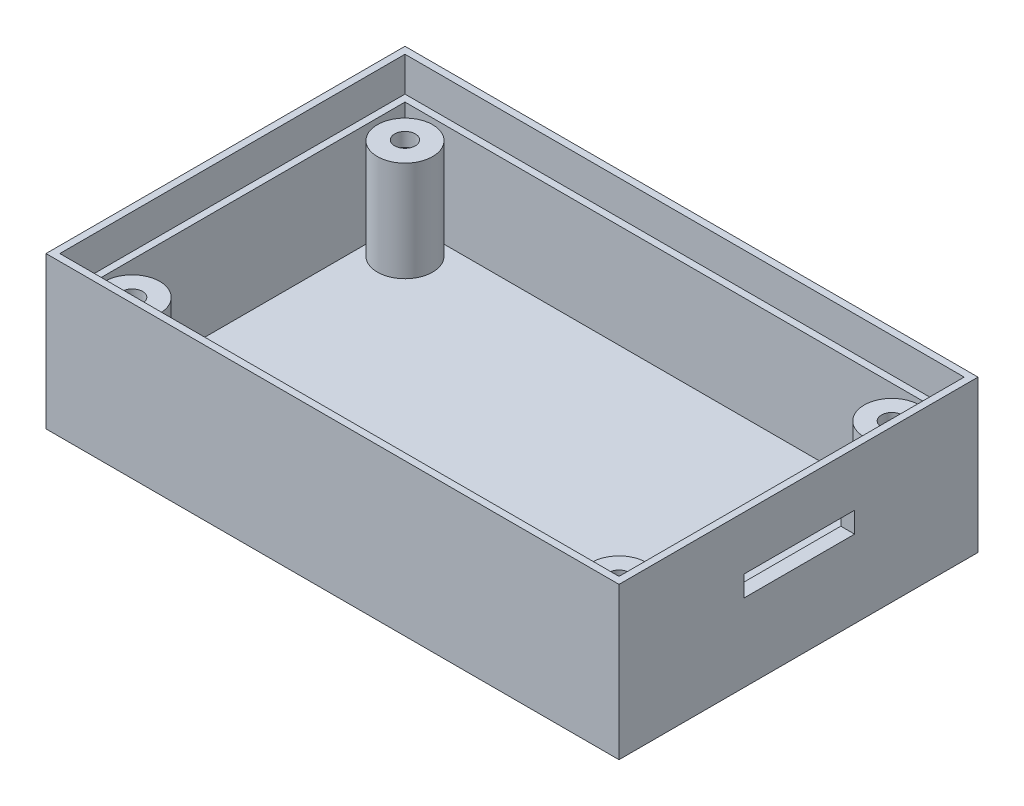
ISO-10303-21;
HEADER;
FILE_DESCRIPTION(('STEP AP214'),'2;1');
FILE_NAME('part.step','',(''),(''),'','','');
FILE_SCHEMA(('AUTOMOTIVE_DESIGN { 1 0 10303 214 1 1 1 1 }'));
ENDSEC;
DATA;
#1=APPLICATION_CONTEXT('core data for automotive mechanical design processes');
#2=APPLICATION_PROTOCOL_DEFINITION('international standard','automotive_design',2000,#1);
#3=PRODUCT_CONTEXT('',#1,'mechanical');
#4=PRODUCT('Part','Part','',(#3));
#5=PRODUCT_RELATED_PRODUCT_CATEGORY('part','',(#4));
#6=PRODUCT_DEFINITION_FORMATION('','',#4);
#7=PRODUCT_DEFINITION_CONTEXT('part definition',#1,'design');
#8=PRODUCT_DEFINITION('design','',#6,#7);
#9=PRODUCT_DEFINITION_SHAPE('','',#8);
#10=(LENGTH_UNIT() NAMED_UNIT(*) SI_UNIT(.MILLI.,.METRE.));
#11=(NAMED_UNIT(*) PLANE_ANGLE_UNIT() SI_UNIT($,.RADIAN.));
#12=(NAMED_UNIT(*) SI_UNIT($,.STERADIAN.) SOLID_ANGLE_UNIT());
#13=UNCERTAINTY_MEASURE_WITH_UNIT(LENGTH_MEASURE(1.E-05),#10,'distance_accuracy_value','');
#14=(GEOMETRIC_REPRESENTATION_CONTEXT(3) GLOBAL_UNCERTAINTY_ASSIGNED_CONTEXT((#13)) GLOBAL_UNIT_ASSIGNED_CONTEXT((#10,
#11,#12)) REPRESENTATION_CONTEXT('',''));
#15=CARTESIAN_POINT('',(0.,0.,0.));
#16=DIRECTION('',(0.,0.,1.));
#17=DIRECTION('',(1.,0.,0.));
#18=AXIS2_PLACEMENT_3D('',#15,#16,#17);
#19=CARTESIAN_POINT('',(60.8159410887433,-3.5,-19.9960274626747));
#20=DIRECTION('',(0.,1.,0.));
#21=DIRECTION('',(0.,0.,1.));
#22=AXIS2_PLACEMENT_3D('',#19,#20,#21);
#23=CYLINDRICAL_SURFACE('',#22,1.5);
#24=CARTESIAN_POINT('',(60.8159410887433,16.5,-19.9960274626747));
#25=DIRECTION('',(0.,1.,0.));
#26=DIRECTION('',(0.,0.,1.));
#27=AXIS2_PLACEMENT_3D('',#24,#25,#26);
#28=CIRCLE('',#27,1.5);
#29=CARTESIAN_POINT('',(60.8159410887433,16.5,-18.4960274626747));
#30=VERTEX_POINT('',#29);
#31=EDGE_CURVE('E218',#30,#30,#28,.T.);
#32=ORIENTED_EDGE('',*,*,#31,.T.);
#33=EDGE_LOOP('',(#32));
#34=FACE_BOUND('',#33,.T.);
#35=CARTESIAN_POINT('',(60.8159410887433,14.5,-19.9960274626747));
#36=DIRECTION('',(0.,-1.,0.));
#37=DIRECTION('',(0.,0.,-1.));
#38=AXIS2_PLACEMENT_3D('',#35,#36,#37);
#39=CIRCLE('',#38,1.5);
#40=CARTESIAN_POINT('',(60.8159410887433,14.5,-21.4960274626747));
#41=VERTEX_POINT('',#40);
#42=EDGE_CURVE('E39',#41,#41,#39,.F.);
#43=ORIENTED_EDGE('',*,*,#42,.F.);
#44=EDGE_LOOP('',(#43));
#45=FACE_BOUND('',#44,.T.);
#46=ADVANCED_FACE('F35',(#34,#45),#23,.F.);
#47=CARTESIAN_POINT('',(60.8159410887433,-3.5,19.5186911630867));
#48=DIRECTION('',(0.,1.,0.));
#49=DIRECTION('',(0.,0.,1.));
#50=AXIS2_PLACEMENT_3D('',#47,#48,#49);
#51=CYLINDRICAL_SURFACE('',#50,1.5);
#52=CARTESIAN_POINT('',(60.8159410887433,16.5,19.5186911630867));
#53=DIRECTION('',(0.,1.,0.));
#54=DIRECTION('',(0.,0.,1.));
#55=AXIS2_PLACEMENT_3D('',#52,#53,#54);
#56=CIRCLE('',#55,1.5);
#57=CARTESIAN_POINT('',(60.8159410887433,16.5,21.0186911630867));
#58=VERTEX_POINT('',#57);
#59=EDGE_CURVE('E215',#58,#58,#56,.T.);
#60=ORIENTED_EDGE('',*,*,#59,.T.);
#61=EDGE_LOOP('',(#60));
#62=FACE_BOUND('',#61,.T.);
#63=CARTESIAN_POINT('',(60.8159410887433,14.5,19.5186911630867));
#64=DIRECTION('',(0.,-1.,0.));
#65=DIRECTION('',(0.,0.,-1.));
#66=AXIS2_PLACEMENT_3D('',#63,#64,#65);
#67=CIRCLE('',#66,1.5);
#68=CARTESIAN_POINT('',(60.8159410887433,14.5,18.0186911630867));
#69=VERTEX_POINT('',#68);
#70=EDGE_CURVE('E344',#69,#69,#67,.F.);
#71=ORIENTED_EDGE('',*,*,#70,.F.);
#72=EDGE_LOOP('',(#71));
#73=FACE_BOUND('',#72,.T.);
#74=ADVANCED_FACE('F354',(#62,#73),#51,.F.);
#75=CARTESIAN_POINT('',(-9.6987775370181,-3.5,19.5186911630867));
#76=DIRECTION('',(0.,1.,0.));
#77=DIRECTION('',(0.,0.,1.));
#78=AXIS2_PLACEMENT_3D('',#75,#76,#77);
#79=CYLINDRICAL_SURFACE('',#78,1.5);
#80=CARTESIAN_POINT('',(-9.6987775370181,16.5,19.5186911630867));
#81=DIRECTION('',(0.,1.,0.));
#82=DIRECTION('',(0.,0.,1.));
#83=AXIS2_PLACEMENT_3D('',#80,#81,#82);
#84=CIRCLE('',#83,1.5);
#85=CARTESIAN_POINT('',(-9.6987775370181,16.5,21.0186911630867));
#86=VERTEX_POINT('',#85);
#87=EDGE_CURVE('E211',#86,#86,#84,.T.);
#88=ORIENTED_EDGE('',*,*,#87,.T.);
#89=EDGE_LOOP('',(#88));
#90=FACE_BOUND('',#89,.T.);
#91=CARTESIAN_POINT('',(-9.6987775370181,14.5,19.5186911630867));
#92=DIRECTION('',(0.,-1.,0.));
#93=DIRECTION('',(0.,0.,-1.));
#94=AXIS2_PLACEMENT_3D('',#91,#92,#93);
#95=CIRCLE('',#94,1.5);
#96=CARTESIAN_POINT('',(-9.6987775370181,14.5,18.0186911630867));
#97=VERTEX_POINT('',#96);
#98=EDGE_CURVE('E342',#97,#97,#95,.F.);
#99=ORIENTED_EDGE('',*,*,#98,.F.);
#100=EDGE_LOOP('',(#99));
#101=FACE_BOUND('',#100,.T.);
#102=ADVANCED_FACE('F360',(#90,#101),#79,.F.);
#103=CARTESIAN_POINT('',(-9.6987775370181,-3.5,-19.9960274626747));
#104=DIRECTION('',(0.,1.,0.));
#105=DIRECTION('',(0.,0.,1.));
#106=AXIS2_PLACEMENT_3D('',#103,#104,#105);
#107=CYLINDRICAL_SURFACE('',#106,1.5);
#108=CARTESIAN_POINT('',(-9.6987775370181,16.5,-19.9960274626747));
#109=DIRECTION('',(0.,1.,0.));
#110=DIRECTION('',(0.,0.,1.));
#111=AXIS2_PLACEMENT_3D('',#108,#109,#110);
#112=CIRCLE('',#111,1.5);
#113=CARTESIAN_POINT('',(-9.6987775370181,16.5,-18.4960274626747));
#114=VERTEX_POINT('',#113);
#115=EDGE_CURVE('E214',#114,#114,#112,.T.);
#116=ORIENTED_EDGE('',*,*,#115,.T.);
#117=EDGE_LOOP('',(#116));
#118=FACE_BOUND('',#117,.T.);
#119=CARTESIAN_POINT('',(-9.6987775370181,14.5,-19.9960274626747));
#120=DIRECTION('',(0.,-1.,0.));
#121=DIRECTION('',(0.,0.,-1.));
#122=AXIS2_PLACEMENT_3D('',#119,#120,#121);
#123=CIRCLE('',#122,1.5);
#124=CARTESIAN_POINT('',(-9.6987775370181,14.5,-21.4960274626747));
#125=VERTEX_POINT('',#124);
#126=EDGE_CURVE('E208',#125,#125,#123,.F.);
#127=ORIENTED_EDGE('',*,*,#126,.F.);
#128=EDGE_LOOP('',(#127));
#129=FACE_BOUND('',#128,.T.);
#130=ADVANCED_FACE('F365',(#118,#129),#107,.F.);
#131=CARTESIAN_POINT('',(-15.9414182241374,2.,-26.238668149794));
#132=DIRECTION('',(1.,0.,0.));
#133=DIRECTION('',(0.,0.,-1.));
#134=AXIS2_PLACEMENT_3D('',#131,#132,#133);
#135=PLANE('',#134);
#136=DIRECTION('',(0.,0.,1.));
#137=VECTOR('',#136,1.);
#138=CARTESIAN_POINT('',(-15.9414182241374,0.,-26.238668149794));
#139=LINE('',#138,#137);
#140=CARTESIAN_POINT('',(-15.9414182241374,0.,-26.238668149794));
#141=VERTEX_POINT('',#140);
#142=CARTESIAN_POINT('',(-15.9414182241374,0.,25.761331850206));
#143=VERTEX_POINT('',#142);
#144=EDGE_CURVE('E320',#141,#143,#139,.T.);
#145=ORIENTED_EDGE('',*,*,#144,.T.);
#146=DIRECTION('',(0.,-1.,0.));
#147=VECTOR('',#146,1.);
#148=CARTESIAN_POINT('',(-15.9414182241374,2.,25.761331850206));
#149=LINE('',#148,#147);
#150=CARTESIAN_POINT('',(-15.9414182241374,22.,25.761331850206));
#151=VERTEX_POINT('',#150);
#152=EDGE_CURVE('E44',#151,#143,#149,.T.);
#153=ORIENTED_EDGE('',*,*,#152,.F.);
#154=DIRECTION('',(0.,0.,1.));
#155=VECTOR('',#154,1.);
#156=CARTESIAN_POINT('',(-15.9414182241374,22.,-26.238668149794));
#157=LINE('',#156,#155);
#158=CARTESIAN_POINT('',(-15.9414182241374,22.,-26.238668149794));
#159=VERTEX_POINT('',#158);
#160=EDGE_CURVE('E308',#159,#151,#157,.T.);
#161=ORIENTED_EDGE('',*,*,#160,.F.);
#162=DIRECTION('',(0.,-1.,0.));
#163=VECTOR('',#162,1.);
#164=CARTESIAN_POINT('',(-15.9414182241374,2.,-26.238668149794));
#165=LINE('',#164,#163);
#166=EDGE_CURVE('E329',#159,#141,#165,.T.);
#167=ORIENTED_EDGE('',*,*,#166,.T.);
#168=EDGE_LOOP('',(#145,#153,#161,#167));
#169=FACE_BOUND('',#168,.T.);
#170=ADVANCED_FACE('F37',(#169),#135,.F.);
#171=CARTESIAN_POINT('',(-15.9414182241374,2.,25.761331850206));
#172=DIRECTION('',(0.,0.,-1.));
#173=DIRECTION('',(-1.,0.,0.));
#174=AXIS2_PLACEMENT_3D('',#171,#172,#173);
#175=PLANE('',#174);
#176=DIRECTION('',(1.,0.,0.));
#177=VECTOR('',#176,1.);
#178=CARTESIAN_POINT('',(-15.9414182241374,0.,25.761331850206));
#179=LINE('',#178,#177);
#180=CARTESIAN_POINT('',(67.0585817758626,0.,25.761331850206));
#181=VERTEX_POINT('',#180);
#182=EDGE_CURVE('E323',#143,#181,#179,.T.);
#183=ORIENTED_EDGE('',*,*,#182,.T.);
#184=DIRECTION('',(0.,-1.,0.));
#185=VECTOR('',#184,1.);
#186=CARTESIAN_POINT('',(67.0585817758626,2.,25.761331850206));
#187=LINE('',#186,#185);
#188=CARTESIAN_POINT('',(67.0585817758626,22.,25.761331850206));
#189=VERTEX_POINT('',#188);
#190=EDGE_CURVE('E335',#189,#181,#187,.T.);
#191=ORIENTED_EDGE('',*,*,#190,.F.);
#192=DIRECTION('',(1.,0.,0.));
#193=VECTOR('',#192,1.);
#194=CARTESIAN_POINT('',(-15.9414182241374,22.,25.761331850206));
#195=LINE('',#194,#193);
#196=EDGE_CURVE('E311',#151,#189,#195,.T.);
#197=ORIENTED_EDGE('',*,*,#196,.F.);
#198=ORIENTED_EDGE('',*,*,#152,.T.);
#199=EDGE_LOOP('',(#183,#191,#197,#198));
#200=FACE_BOUND('',#199,.T.);
#201=ADVANCED_FACE('F454',(#200),#175,.F.);
#202=CARTESIAN_POINT('',(67.0585817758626,2.,25.761331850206));
#203=DIRECTION('',(-1.,0.,0.));
#204=DIRECTION('',(0.,0.,1.));
#205=AXIS2_PLACEMENT_3D('',#202,#203,#204);
#206=PLANE('',#205);
#207=DIRECTION('',(0.,0.,1.));
#208=VECTOR('',#207,1.);
#209=CARTESIAN_POINT('',(67.0585817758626,14.2393531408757,-8.36321300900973));
#210=LINE('',#209,#208);
#211=CARTESIAN_POINT('',(67.0585817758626,14.2393531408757,-8.36321300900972));
#212=VERTEX_POINT('',#211);
#213=CARTESIAN_POINT('',(67.0585817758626,14.2393531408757,7.63678699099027));
#214=VERTEX_POINT('',#213);
#215=EDGE_CURVE('E177',#212,#214,#210,.T.);
#216=ORIENTED_EDGE('',*,*,#215,.F.);
#217=DIRECTION('',(0.,1.,0.));
#218=VECTOR('',#217,1.);
#219=CARTESIAN_POINT('',(67.0585817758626,11.2355893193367,-8.36321300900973));
#220=LINE('',#219,#218);
#221=CARTESIAN_POINT('',(67.0585817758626,11.2355893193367,-8.36321300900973));
#222=VERTEX_POINT('',#221);
#223=EDGE_CURVE('E52',#222,#212,#220,.T.);
#224=ORIENTED_EDGE('',*,*,#223,.F.);
#225=DIRECTION('',(0.,0.,-1.));
#226=VECTOR('',#225,1.);
#227=CARTESIAN_POINT('',(67.0585817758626,11.2355893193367,-8.36321300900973));
#228=LINE('',#227,#226);
#229=CARTESIAN_POINT('',(67.0585817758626,11.2355893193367,7.63678699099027));
#230=VERTEX_POINT('',#229);
#231=EDGE_CURVE('E168',#230,#222,#228,.T.);
#232=ORIENTED_EDGE('',*,*,#231,.F.);
#233=DIRECTION('',(0.,-1.,0.));
#234=VECTOR('',#233,1.);
#235=CARTESIAN_POINT('',(67.0585817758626,14.2393531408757,7.63678699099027));
#236=LINE('',#235,#234);
#237=EDGE_CURVE('E171',#214,#230,#236,.T.);
#238=ORIENTED_EDGE('',*,*,#237,.F.);
#239=EDGE_LOOP('',(#216,#224,#232,#238));
#240=FACE_BOUND('',#239,.T.);
#241=DIRECTION('',(0.,0.,-1.));
#242=VECTOR('',#241,1.);
#243=CARTESIAN_POINT('',(67.0585817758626,0.,25.761331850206));
#244=LINE('',#243,#242);
#245=CARTESIAN_POINT('',(67.0585817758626,0.,-26.238668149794));
#246=VERTEX_POINT('',#245);
#247=EDGE_CURVE('E325',#181,#246,#244,.T.);
#248=ORIENTED_EDGE('',*,*,#247,.T.);
#249=DIRECTION('',(0.,-1.,0.));
#250=VECTOR('',#249,1.);
#251=CARTESIAN_POINT('',(67.0585817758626,2.,-26.238668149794));
#252=LINE('',#251,#250);
#253=CARTESIAN_POINT('',(67.0585817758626,22.,-26.238668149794));
#254=VERTEX_POINT('',#253);
#255=EDGE_CURVE('E332',#254,#246,#252,.T.);
#256=ORIENTED_EDGE('',*,*,#255,.F.);
#257=DIRECTION('',(0.,0.,-1.));
#258=VECTOR('',#257,1.);
#259=CARTESIAN_POINT('',(67.0585817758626,22.,-26.238668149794));
#260=LINE('',#259,#258);
#261=EDGE_CURVE('E314',#189,#254,#260,.T.);
#262=ORIENTED_EDGE('',*,*,#261,.F.);
#263=ORIENTED_EDGE('',*,*,#190,.T.);
#264=EDGE_LOOP('',(#248,#256,#262,#263));
#265=FACE_BOUND('',#264,.T.);
#266=ADVANCED_FACE('F451',(#240,#265),#206,.F.);
#267=CARTESIAN_POINT('',(67.0585817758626,2.,-26.238668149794));
#268=DIRECTION('',(0.,0.,1.));
#269=DIRECTION('',(1.,0.,0.));
#270=AXIS2_PLACEMENT_3D('',#267,#268,#269);
#271=PLANE('',#270);
#272=DIRECTION('',(-1.,0.,0.));
#273=VECTOR('',#272,1.);
#274=CARTESIAN_POINT('',(67.0585817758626,0.,-26.238668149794));
#275=LINE('',#274,#273);
#276=EDGE_CURVE('E327',#246,#141,#275,.T.);
#277=ORIENTED_EDGE('',*,*,#276,.T.);
#278=ORIENTED_EDGE('',*,*,#166,.F.);
#279=DIRECTION('',(-1.,0.,0.));
#280=VECTOR('',#279,1.);
#281=CARTESIAN_POINT('',(-15.9414182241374,22.,-26.238668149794));
#282=LINE('',#281,#280);
#283=EDGE_CURVE('E317',#254,#159,#282,.T.);
#284=ORIENTED_EDGE('',*,*,#283,.F.);
#285=ORIENTED_EDGE('',*,*,#255,.T.);
#286=EDGE_LOOP('',(#277,#278,#284,#285));
#287=FACE_BOUND('',#286,.T.);
#288=ADVANCED_FACE('F447',(#287),#271,.F.);
#289=CARTESIAN_POINT('',(0.,0.,0.));
#290=DIRECTION('',(0.,1.,0.));
#291=DIRECTION('',(0.,0.,1.));
#292=AXIS2_PLACEMENT_3D('',#289,#290,#291);
#293=PLANE('',#292);
#294=CARTESIAN_POINT('',(-9.6987775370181,0.,-19.9960274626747));
#295=DIRECTION('',(0.,-1.,0.));
#296=DIRECTION('',(0.,0.,-1.));
#297=AXIS2_PLACEMENT_3D('',#294,#295,#296);
#298=CIRCLE('',#297,2.5);
#299=CARTESIAN_POINT('',(-9.6987775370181,0.,-22.4960274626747));
#300=VERTEX_POINT('',#299);
#301=EDGE_CURVE('E183',#300,#300,#298,.T.);
#302=ORIENTED_EDGE('',*,*,#301,.F.);
#303=EDGE_LOOP('',(#302));
#304=FACE_BOUND('',#303,.T.);
#305=CARTESIAN_POINT('',(60.8159410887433,0.,-19.9960274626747));
#306=DIRECTION('',(0.,-1.,0.));
#307=DIRECTION('',(0.,0.,-1.));
#308=AXIS2_PLACEMENT_3D('',#305,#306,#307);
#309=CIRCLE('',#308,2.5);
#310=CARTESIAN_POINT('',(60.8159410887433,0.,-22.4960274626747));
#311=VERTEX_POINT('',#310);
#312=EDGE_CURVE('E197',#311,#311,#309,.T.);
#313=ORIENTED_EDGE('',*,*,#312,.F.);
#314=EDGE_LOOP('',(#313));
#315=FACE_BOUND('',#314,.T.);
#316=CARTESIAN_POINT('',(60.8159410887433,0.,19.5186911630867));
#317=DIRECTION('',(0.,-1.,0.));
#318=DIRECTION('',(0.,0.,-1.));
#319=AXIS2_PLACEMENT_3D('',#316,#317,#318);
#320=CIRCLE('',#319,2.5);
#321=CARTESIAN_POINT('',(60.8159410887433,0.,17.0186911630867));
#322=VERTEX_POINT('',#321);
#323=EDGE_CURVE('E191',#322,#322,#320,.T.);
#324=ORIENTED_EDGE('',*,*,#323,.F.);
#325=EDGE_LOOP('',(#324));
#326=FACE_BOUND('',#325,.T.);
#327=CARTESIAN_POINT('',(-9.6987775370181,0.,19.5186911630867));
#328=DIRECTION('',(0.,-1.,0.));
#329=DIRECTION('',(0.,0.,-1.));
#330=AXIS2_PLACEMENT_3D('',#327,#328,#329);
#331=CIRCLE('',#330,2.5);
#332=CARTESIAN_POINT('',(-9.6987775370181,0.,17.0186911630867));
#333=VERTEX_POINT('',#332);
#334=EDGE_CURVE('E190',#333,#333,#331,.T.);
#335=ORIENTED_EDGE('',*,*,#334,.F.);
#336=EDGE_LOOP('',(#335));
#337=FACE_BOUND('',#336,.T.);
#338=ORIENTED_EDGE('',*,*,#144,.F.);
#339=ORIENTED_EDGE('',*,*,#276,.F.);
#340=ORIENTED_EDGE('',*,*,#247,.F.);
#341=ORIENTED_EDGE('',*,*,#182,.F.);
#342=EDGE_LOOP('',(#338,#339,#340,#341));
#343=FACE_BOUND('',#342,.T.);
#344=ADVANCED_FACE('F440',(#304,#315,#326,#337,#343),#293,.F.);
#345=CARTESIAN_POINT('',(0.,22.,0.));
#346=DIRECTION('',(0.,1.,0.));
#347=DIRECTION('',(0.,0.,1.));
#348=AXIS2_PLACEMENT_3D('',#345,#346,#347);
#349=PLANE('',#348);
#350=DIRECTION('',(0.,0.,1.));
#351=VECTOR('',#350,1.);
#352=CARTESIAN_POINT('',(-14.9414182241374,22.,-25.238668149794));
#353=LINE('',#352,#351);
#354=CARTESIAN_POINT('',(-14.9414182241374,22.,-25.238668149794));
#355=VERTEX_POINT('',#354);
#356=CARTESIAN_POINT('',(-14.9414182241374,22.,24.761331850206));
#357=VERTEX_POINT('',#356);
#358=EDGE_CURVE('E245',#355,#357,#353,.T.);
#359=ORIENTED_EDGE('',*,*,#358,.F.);
#360=DIRECTION('',(-1.,0.,0.));
#361=VECTOR('',#360,1.);
#362=CARTESIAN_POINT('',(-14.9414182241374,22.,-25.238668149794));
#363=LINE('',#362,#361);
#364=CARTESIAN_POINT('',(66.0585817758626,22.,-25.238668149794));
#365=VERTEX_POINT('',#364);
#366=EDGE_CURVE('E252',#365,#355,#363,.T.);
#367=ORIENTED_EDGE('',*,*,#366,.F.);
#368=DIRECTION('',(0.,0.,-1.));
#369=VECTOR('',#368,1.);
#370=CARTESIAN_POINT('',(66.0585817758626,22.,-25.238668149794));
#371=LINE('',#370,#369);
#372=CARTESIAN_POINT('',(66.0585817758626,22.,24.761331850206));
#373=VERTEX_POINT('',#372);
#374=EDGE_CURVE('E266',#373,#365,#371,.T.);
#375=ORIENTED_EDGE('',*,*,#374,.F.);
#376=DIRECTION('',(1.,0.,0.));
#377=VECTOR('',#376,1.);
#378=CARTESIAN_POINT('',(-14.9414182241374,22.,24.761331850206));
#379=LINE('',#378,#377);
#380=EDGE_CURVE('E263',#357,#373,#379,.T.);
#381=ORIENTED_EDGE('',*,*,#380,.F.);
#382=EDGE_LOOP('',(#359,#367,#375,#381));
#383=FACE_BOUND('',#382,.T.);
#384=ORIENTED_EDGE('',*,*,#160,.T.);
#385=ORIENTED_EDGE('',*,*,#196,.T.);
#386=ORIENTED_EDGE('',*,*,#261,.T.);
#387=ORIENTED_EDGE('',*,*,#283,.T.);
#388=EDGE_LOOP('',(#384,#385,#386,#387));
#389=FACE_BOUND('',#388,.T.);
#390=ADVANCED_FACE('F423',(#383,#389),#349,.T.);
#391=CARTESIAN_POINT('',(-14.9414182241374,17.,-25.238668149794));
#392=DIRECTION('',(-1.,0.,0.));
#393=DIRECTION('',(0.,0.,1.));
#394=AXIS2_PLACEMENT_3D('',#391,#392,#393);
#395=PLANE('',#394);
#396=ORIENTED_EDGE('',*,*,#358,.T.);
#397=DIRECTION('',(0.,1.,0.));
#398=VECTOR('',#397,1.);
#399=CARTESIAN_POINT('',(-14.9414182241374,17.,24.761331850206));
#400=LINE('',#399,#398);
#401=CARTESIAN_POINT('',(-14.9414182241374,17.,24.761331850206));
#402=VERTEX_POINT('',#401);
#403=EDGE_CURVE('E261',#402,#357,#400,.T.);
#404=ORIENTED_EDGE('',*,*,#403,.F.);
#405=DIRECTION('',(0.,0.,1.));
#406=VECTOR('',#405,1.);
#407=CARTESIAN_POINT('',(-14.9414182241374,17.,-25.238668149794));
#408=LINE('',#407,#406);
#409=CARTESIAN_POINT('',(-14.9414182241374,17.,-25.238668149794));
#410=VERTEX_POINT('',#409);
#411=EDGE_CURVE('E248',#410,#402,#408,.T.);
#412=ORIENTED_EDGE('',*,*,#411,.F.);
#413=DIRECTION('',(0.,1.,0.));
#414=VECTOR('',#413,1.);
#415=CARTESIAN_POINT('',(-14.9414182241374,17.,-25.238668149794));
#416=LINE('',#415,#414);
#417=EDGE_CURVE('E271',#410,#355,#416,.T.);
#418=ORIENTED_EDGE('',*,*,#417,.T.);
#419=EDGE_LOOP('',(#396,#404,#412,#418));
#420=FACE_BOUND('',#419,.T.);
#421=ADVANCED_FACE('F413',(#420),#395,.F.);
#422=CARTESIAN_POINT('',(-14.9414182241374,17.,-25.238668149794));
#423=DIRECTION('',(0.,0.,-1.));
#424=DIRECTION('',(-1.,0.,0.));
#425=AXIS2_PLACEMENT_3D('',#422,#423,#424);
#426=PLANE('',#425);
#427=ORIENTED_EDGE('',*,*,#366,.T.);
#428=ORIENTED_EDGE('',*,*,#417,.F.);
#429=DIRECTION('',(-1.,0.,0.));
#430=VECTOR('',#429,1.);
#431=CARTESIAN_POINT('',(-14.9414182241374,17.,-25.238668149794));
#432=LINE('',#431,#430);
#433=CARTESIAN_POINT('',(66.0585817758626,17.,-25.238668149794));
#434=VERTEX_POINT('',#433);
#435=EDGE_CURVE('E258',#434,#410,#432,.T.);
#436=ORIENTED_EDGE('',*,*,#435,.F.);
#437=DIRECTION('',(0.,1.,0.));
#438=VECTOR('',#437,1.);
#439=CARTESIAN_POINT('',(66.0585817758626,17.,-25.238668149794));
#440=LINE('',#439,#438);
#441=EDGE_CURVE('E274',#434,#365,#440,.T.);
#442=ORIENTED_EDGE('',*,*,#441,.T.);
#443=EDGE_LOOP('',(#427,#428,#436,#442));
#444=FACE_BOUND('',#443,.T.);
#445=ADVANCED_FACE('F409',(#444),#426,.F.);
#446=CARTESIAN_POINT('',(66.0585817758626,17.,-25.238668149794));
#447=DIRECTION('',(1.,0.,0.));
#448=DIRECTION('',(0.,0.,-1.));
#449=AXIS2_PLACEMENT_3D('',#446,#447,#448);
#450=PLANE('',#449);
#451=ORIENTED_EDGE('',*,*,#374,.T.);
#452=ORIENTED_EDGE('',*,*,#441,.F.);
#453=DIRECTION('',(0.,0.,-1.));
#454=VECTOR('',#453,1.);
#455=CARTESIAN_POINT('',(66.0585817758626,17.,-25.238668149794));
#456=LINE('',#455,#454);
#457=CARTESIAN_POINT('',(66.0585817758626,17.,24.761331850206));
#458=VERTEX_POINT('',#457);
#459=EDGE_CURVE('E255',#458,#434,#456,.T.);
#460=ORIENTED_EDGE('',*,*,#459,.F.);
#461=DIRECTION('',(0.,1.,0.));
#462=VECTOR('',#461,1.);
#463=CARTESIAN_POINT('',(66.0585817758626,17.,24.761331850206));
#464=LINE('',#463,#462);
#465=EDGE_CURVE('E276',#458,#373,#464,.T.);
#466=ORIENTED_EDGE('',*,*,#465,.T.);
#467=EDGE_LOOP('',(#451,#452,#460,#466));
#468=FACE_BOUND('',#467,.T.);
#469=ADVANCED_FACE('F412',(#468),#450,.F.);
#470=CARTESIAN_POINT('',(-14.9414182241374,17.,24.761331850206));
#471=DIRECTION('',(0.,0.,1.));
#472=DIRECTION('',(1.,0.,0.));
#473=AXIS2_PLACEMENT_3D('',#470,#471,#472);
#474=PLANE('',#473);
#475=ORIENTED_EDGE('',*,*,#380,.T.);
#476=ORIENTED_EDGE('',*,*,#465,.F.);
#477=DIRECTION('',(1.,0.,0.));
#478=VECTOR('',#477,1.);
#479=CARTESIAN_POINT('',(-14.9414182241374,17.,24.761331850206));
#480=LINE('',#479,#478);
#481=EDGE_CURVE('E251',#402,#458,#480,.T.);
#482=ORIENTED_EDGE('',*,*,#481,.F.);
#483=ORIENTED_EDGE('',*,*,#403,.T.);
#484=EDGE_LOOP('',(#475,#476,#482,#483));
#485=FACE_BOUND('',#484,.T.);
#486=ADVANCED_FACE('F407',(#485),#474,.F.);
#487=CARTESIAN_POINT('',(0.,17.,0.));
#488=DIRECTION('',(0.,1.,0.));
#489=DIRECTION('',(0.,0.,1.));
#490=AXIS2_PLACEMENT_3D('',#487,#488,#489);
#491=PLANE('',#490);
#492=DIRECTION('',(-1.,0.,0.));
#493=VECTOR('',#492,1.);
#494=CARTESIAN_POINT('',(-13.9414182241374,17.,-24.238668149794));
#495=LINE('',#494,#493);
#496=CARTESIAN_POINT('',(65.0585817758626,17.,-24.238668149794));
#497=VERTEX_POINT('',#496);
#498=CARTESIAN_POINT('',(-13.9414182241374,17.,-24.238668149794));
#499=VERTEX_POINT('',#498);
#500=EDGE_CURVE('E11',#497,#499,#495,.T.);
#501=ORIENTED_EDGE('',*,*,#500,.F.);
#502=DIRECTION('',(0.,0.,-1.));
#503=VECTOR('',#502,1.);
#504=CARTESIAN_POINT('',(65.0585817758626,17.,-24.238668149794));
#505=LINE('',#504,#503);
#506=CARTESIAN_POINT('',(65.0585817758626,17.,23.761331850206));
#507=VERTEX_POINT('',#506);
#508=EDGE_CURVE('E273',#507,#497,#505,.T.);
#509=ORIENTED_EDGE('',*,*,#508,.F.);
#510=DIRECTION('',(1.,0.,0.));
#511=VECTOR('',#510,1.);
#512=CARTESIAN_POINT('',(-13.9414182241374,17.,23.761331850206));
#513=LINE('',#512,#511);
#514=CARTESIAN_POINT('',(-13.9414182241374,17.,23.761331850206));
#515=VERTEX_POINT('',#514);
#516=EDGE_CURVE('E282',#515,#507,#513,.T.);
#517=ORIENTED_EDGE('',*,*,#516,.F.);
#518=DIRECTION('',(0.,0.,1.));
#519=VECTOR('',#518,1.);
#520=CARTESIAN_POINT('',(-13.9414182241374,17.,-24.238668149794));
#521=LINE('',#520,#519);
#522=EDGE_CURVE('E285',#499,#515,#521,.T.);
#523=ORIENTED_EDGE('',*,*,#522,.F.);
#524=EDGE_LOOP('',(#501,#509,#517,#523));
#525=FACE_BOUND('',#524,.T.);
#526=ORIENTED_EDGE('',*,*,#411,.T.);
#527=ORIENTED_EDGE('',*,*,#481,.T.);
#528=ORIENTED_EDGE('',*,*,#459,.T.);
#529=ORIENTED_EDGE('',*,*,#435,.T.);
#530=EDGE_LOOP('',(#526,#527,#528,#529));
#531=FACE_BOUND('',#530,.T.);
#532=ADVANCED_FACE('F403',(#525,#531),#491,.T.);
#533=CARTESIAN_POINT('',(0.,2.,0.));
#534=DIRECTION('',(0.,1.,0.));
#535=DIRECTION('',(0.,0.,1.));
#536=AXIS2_PLACEMENT_3D('',#533,#534,#535);
#537=PLANE('',#536);
#538=CARTESIAN_POINT('',(60.8159410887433,2.,-19.9960274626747));
#539=DIRECTION('',(0.,1.,0.));
#540=DIRECTION('',(0.,0.,1.));
#541=AXIS2_PLACEMENT_3D('',#538,#539,#540);
#542=CIRCLE('',#541,4.00000000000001);
#543=CARTESIAN_POINT('',(60.8159410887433,2.,-23.9960274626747));
#544=VERTEX_POINT('',#543);
#545=EDGE_CURVE('E223',#544,#544,#542,.T.);
#546=ORIENTED_EDGE('',*,*,#545,.F.);
#547=EDGE_LOOP('',(#546));
#548=FACE_BOUND('',#547,.T.);
#549=CARTESIAN_POINT('',(60.8159410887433,2.,19.5186911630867));
#550=DIRECTION('',(0.,1.,0.));
#551=DIRECTION('',(0.,0.,1.));
#552=AXIS2_PLACEMENT_3D('',#549,#550,#551);
#553=CIRCLE('',#552,4.);
#554=CARTESIAN_POINT('',(60.8159410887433,2.,15.5186911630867));
#555=VERTEX_POINT('',#554);
#556=EDGE_CURVE('E227',#555,#555,#553,.T.);
#557=ORIENTED_EDGE('',*,*,#556,.F.);
#558=EDGE_LOOP('',(#557));
#559=FACE_BOUND('',#558,.T.);
#560=CARTESIAN_POINT('',(-9.6987775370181,2.,19.5186911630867));
#561=DIRECTION('',(0.,1.,0.));
#562=DIRECTION('',(0.,0.,1.));
#563=AXIS2_PLACEMENT_3D('',#560,#561,#562);
#564=CIRCLE('',#563,4.);
#565=CARTESIAN_POINT('',(-9.6987775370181,2.,15.5186911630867));
#566=VERTEX_POINT('',#565);
#567=EDGE_CURVE('E233',#566,#566,#564,.T.);
#568=ORIENTED_EDGE('',*,*,#567,.F.);
#569=EDGE_LOOP('',(#568));
#570=FACE_BOUND('',#569,.T.);
#571=CARTESIAN_POINT('',(-9.60466787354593,2.,-19.9019177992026));
#572=DIRECTION('',(0.,1.,0.));
#573=DIRECTION('',(0.,0.,1.));
#574=AXIS2_PLACEMENT_3D('',#571,#572,#573);
#575=CIRCLE('',#574,4.);
#576=CARTESIAN_POINT('',(-9.60466787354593,2.,-23.9019177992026));
#577=VERTEX_POINT('',#576);
#578=EDGE_CURVE('E239',#577,#577,#575,.T.);
#579=ORIENTED_EDGE('',*,*,#578,.F.);
#580=EDGE_LOOP('',(#579));
#581=FACE_BOUND('',#580,.T.);
#582=DIRECTION('',(0.,0.,1.));
#583=VECTOR('',#582,1.);
#584=CARTESIAN_POINT('',(-13.9414182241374,2.,-24.238668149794));
#585=LINE('',#584,#583);
#586=CARTESIAN_POINT('',(-13.9414182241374,2.,-24.238668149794));
#587=VERTEX_POINT('',#586);
#588=CARTESIAN_POINT('',(-13.9414182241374,2.,23.761331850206));
#589=VERTEX_POINT('',#588);
#590=EDGE_CURVE('E288',#587,#589,#585,.T.);
#591=ORIENTED_EDGE('',*,*,#590,.T.);
#592=DIRECTION('',(1.,0.,0.));
#593=VECTOR('',#592,1.);
#594=CARTESIAN_POINT('',(-13.9414182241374,2.,23.761331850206));
#595=LINE('',#594,#593);
#596=CARTESIAN_POINT('',(65.0585817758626,2.,23.761331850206));
#597=VERTEX_POINT('',#596);
#598=EDGE_CURVE('E291',#589,#597,#595,.T.);
#599=ORIENTED_EDGE('',*,*,#598,.T.);
#600=DIRECTION('',(0.,0.,-1.));
#601=VECTOR('',#600,1.);
#602=CARTESIAN_POINT('',(65.0585817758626,2.,-24.238668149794));
#603=LINE('',#602,#601);
#604=CARTESIAN_POINT('',(65.0585817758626,2.,-24.238668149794));
#605=VERTEX_POINT('',#604);
#606=EDGE_CURVE('E294',#597,#605,#603,.T.);
#607=ORIENTED_EDGE('',*,*,#606,.T.);
#608=DIRECTION('',(-1.,0.,0.));
#609=VECTOR('',#608,1.);
#610=CARTESIAN_POINT('',(-13.9414182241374,2.,-24.238668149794));
#611=LINE('',#610,#609);
#612=EDGE_CURVE('E297',#605,#587,#611,.T.);
#613=ORIENTED_EDGE('',*,*,#612,.T.);
#614=EDGE_LOOP('',(#591,#599,#607,#613));
#615=FACE_BOUND('',#614,.T.);
#616=ADVANCED_FACE('F406',(#548,#559,#570,#581,#615),#537,.T.);
#617=CARTESIAN_POINT('',(-13.9414182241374,22.,-24.238668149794));
#618=DIRECTION('',(0.,0.,1.));
#619=DIRECTION('',(1.,0.,0.));
#620=AXIS2_PLACEMENT_3D('',#617,#618,#619);
#621=PLANE('',#620);
#622=DIRECTION('',(0.,-1.,0.));
#623=VECTOR('',#622,1.);
#624=CARTESIAN_POINT('',(65.0585817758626,22.,-24.238668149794));
#625=LINE('',#624,#623);
#626=EDGE_CURVE('E302',#497,#605,#625,.T.);
#627=ORIENTED_EDGE('',*,*,#626,.F.);
#628=ORIENTED_EDGE('',*,*,#500,.T.);
#629=DIRECTION('',(0.,-1.,0.));
#630=VECTOR('',#629,1.);
#631=CARTESIAN_POINT('',(-13.9414182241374,22.,-24.238668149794));
#632=LINE('',#631,#630);
#633=EDGE_CURVE('E300',#499,#587,#632,.T.);
#634=ORIENTED_EDGE('',*,*,#633,.T.);
#635=ORIENTED_EDGE('',*,*,#612,.F.);
#636=EDGE_LOOP('',(#627,#628,#634,#635));
#637=FACE_BOUND('',#636,.T.);
#638=ADVANCED_FACE('F425',(#637),#621,.T.);
#639=CARTESIAN_POINT('',(65.0585817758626,22.,-24.238668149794));
#640=DIRECTION('',(-1.,0.,0.));
#641=DIRECTION('',(0.,0.,1.));
#642=AXIS2_PLACEMENT_3D('',#639,#640,#641);
#643=PLANE('',#642);
#644=DIRECTION('',(0.,1.,0.));
#645=VECTOR('',#644,1.);
#646=CARTESIAN_POINT('',(65.0585817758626,11.2355893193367,-8.36321300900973));
#647=LINE('',#646,#645);
#648=CARTESIAN_POINT('',(65.0585817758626,11.2355893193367,-8.36321300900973));
#649=VERTEX_POINT('',#648);
#650=CARTESIAN_POINT('',(65.0585817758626,14.2393531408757,-8.36321300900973));
#651=VERTEX_POINT('',#650);
#652=EDGE_CURVE('E152',#649,#651,#647,.T.);
#653=ORIENTED_EDGE('',*,*,#652,.T.);
#654=DIRECTION('',(0.,0.,1.));
#655=VECTOR('',#654,1.);
#656=CARTESIAN_POINT('',(65.0585817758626,14.2393531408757,-8.36321300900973));
#657=LINE('',#656,#655);
#658=CARTESIAN_POINT('',(65.0585817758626,14.2393531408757,7.63678699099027));
#659=VERTEX_POINT('',#658);
#660=EDGE_CURVE('E161',#651,#659,#657,.T.);
#661=ORIENTED_EDGE('',*,*,#660,.T.);
#662=DIRECTION('',(0.,-1.,0.));
#663=VECTOR('',#662,1.);
#664=CARTESIAN_POINT('',(65.0585817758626,14.2393531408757,7.63678699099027));
#665=LINE('',#664,#663);
#666=CARTESIAN_POINT('',(65.0585817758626,11.2355893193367,7.63678699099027));
#667=VERTEX_POINT('',#666);
#668=EDGE_CURVE('E60',#659,#667,#665,.T.);
#669=ORIENTED_EDGE('',*,*,#668,.T.);
#670=DIRECTION('',(0.,0.,-1.));
#671=VECTOR('',#670,1.);
#672=CARTESIAN_POINT('',(65.0585817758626,11.2355893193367,-8.36321300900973));
#673=LINE('',#672,#671);
#674=EDGE_CURVE('E158',#667,#649,#673,.T.);
#675=ORIENTED_EDGE('',*,*,#674,.T.);
#676=EDGE_LOOP('',(#653,#661,#669,#675));
#677=FACE_BOUND('',#676,.T.);
#678=DIRECTION('',(0.,-1.,0.));
#679=VECTOR('',#678,1.);
#680=CARTESIAN_POINT('',(65.0585817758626,22.,23.761331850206));
#681=LINE('',#680,#679);
#682=EDGE_CURVE('E304',#507,#597,#681,.T.);
#683=ORIENTED_EDGE('',*,*,#682,.F.);
#684=ORIENTED_EDGE('',*,*,#508,.T.);
#685=ORIENTED_EDGE('',*,*,#626,.T.);
#686=ORIENTED_EDGE('',*,*,#606,.F.);
#687=EDGE_LOOP('',(#683,#684,#685,#686));
#688=FACE_BOUND('',#687,.T.);
#689=ADVANCED_FACE('F165',(#677,#688),#643,.T.);
#690=CARTESIAN_POINT('',(-13.9414182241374,22.,23.761331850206));
#691=DIRECTION('',(0.,0.,-1.));
#692=DIRECTION('',(-1.,0.,0.));
#693=AXIS2_PLACEMENT_3D('',#690,#691,#692);
#694=PLANE('',#693);
#695=DIRECTION('',(0.,-1.,0.));
#696=VECTOR('',#695,1.);
#697=CARTESIAN_POINT('',(-13.9414182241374,22.,23.761331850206));
#698=LINE('',#697,#696);
#699=EDGE_CURVE('E306',#515,#589,#698,.T.);
#700=ORIENTED_EDGE('',*,*,#699,.F.);
#701=ORIENTED_EDGE('',*,*,#516,.T.);
#702=ORIENTED_EDGE('',*,*,#682,.T.);
#703=ORIENTED_EDGE('',*,*,#598,.F.);
#704=EDGE_LOOP('',(#700,#701,#702,#703));
#705=FACE_BOUND('',#704,.T.);
#706=ADVANCED_FACE('F431',(#705),#694,.T.);
#707=CARTESIAN_POINT('',(-13.9414182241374,22.,-24.238668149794));
#708=DIRECTION('',(1.,0.,0.));
#709=DIRECTION('',(0.,0.,-1.));
#710=AXIS2_PLACEMENT_3D('',#707,#708,#709);
#711=PLANE('',#710);
#712=ORIENTED_EDGE('',*,*,#633,.F.);
#713=ORIENTED_EDGE('',*,*,#522,.T.);
#714=ORIENTED_EDGE('',*,*,#699,.T.);
#715=ORIENTED_EDGE('',*,*,#590,.F.);
#716=EDGE_LOOP('',(#712,#713,#714,#715));
#717=FACE_BOUND('',#716,.T.);
#718=ADVANCED_FACE('F401',(#717),#711,.T.);
#719=CARTESIAN_POINT('',(-9.60466787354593,16.5,-19.9019177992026));
#720=DIRECTION('',(0.,-1.,0.));
#721=DIRECTION('',(0.,0.,-1.));
#722=AXIS2_PLACEMENT_3D('',#719,#720,#721);
#723=CYLINDRICAL_SURFACE('',#722,4.);
#724=CARTESIAN_POINT('',(-9.60466787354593,16.5,-19.9019177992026));
#725=DIRECTION('',(0.,1.,0.));
#726=DIRECTION('',(0.,0.,1.));
#727=AXIS2_PLACEMENT_3D('',#724,#725,#726);
#728=CIRCLE('',#727,4.);
#729=CARTESIAN_POINT('',(-9.60466787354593,16.5,-23.9019177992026));
#730=VERTEX_POINT('',#729);
#731=EDGE_CURVE('E242',#730,#730,#728,.T.);
#732=CARTESIAN_POINT('',(-9.60466787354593,16.5,-23.9019177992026));
#733=CARTESIAN_POINT('',(-9.60466787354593,16.3489583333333,-23.9019177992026));
#734=CARTESIAN_POINT('',(-9.60466787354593,16.1979166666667,-23.9019177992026));
#735=CARTESIAN_POINT('',(-9.60466787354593,15.8958333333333,-23.9019177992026));
#736=CARTESIAN_POINT('',(-9.60466787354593,15.7447916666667,-23.9019177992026));
#737=CARTESIAN_POINT('',(-9.60466787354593,15.4427083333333,-23.9019177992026));
#738=CARTESIAN_POINT('',(-9.60466787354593,15.2916666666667,-23.9019177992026));
#739=CARTESIAN_POINT('',(-9.60466787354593,14.9895833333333,-23.9019177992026));
#740=CARTESIAN_POINT('',(-9.60466787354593,14.8385416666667,-23.9019177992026));
#741=CARTESIAN_POINT('',(-9.60466787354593,14.5364583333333,-23.9019177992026));
#742=CARTESIAN_POINT('',(-9.60466787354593,14.3854166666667,-23.9019177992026));
#743=CARTESIAN_POINT('',(-9.60466787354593,14.0833333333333,-23.9019177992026));
#744=CARTESIAN_POINT('',(-9.60466787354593,13.9322916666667,-23.9019177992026));
#745=CARTESIAN_POINT('',(-9.60466787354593,13.6302083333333,-23.9019177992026));
#746=CARTESIAN_POINT('',(-9.60466787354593,13.4791666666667,-23.9019177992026));
#747=CARTESIAN_POINT('',(-9.60466787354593,13.1770833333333,-23.9019177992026));
#748=CARTESIAN_POINT('',(-9.60466787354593,13.0260416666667,-23.9019177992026));
#749=CARTESIAN_POINT('',(-9.60466787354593,12.7239583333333,-23.9019177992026));
#750=CARTESIAN_POINT('',(-9.60466787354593,12.5729166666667,-23.9019177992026));
#751=CARTESIAN_POINT('',(-9.60466787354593,12.2708333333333,-23.9019177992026));
#752=CARTESIAN_POINT('',(-9.60466787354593,12.1197916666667,-23.9019177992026));
#753=CARTESIAN_POINT('',(-9.60466787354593,11.8177083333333,-23.9019177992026));
#754=CARTESIAN_POINT('',(-9.60466787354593,11.6666666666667,-23.9019177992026));
#755=CARTESIAN_POINT('',(-9.60466787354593,11.3645833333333,-23.9019177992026));
#756=CARTESIAN_POINT('',(-9.60466787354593,11.2135416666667,-23.9019177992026));
#757=CARTESIAN_POINT('',(-9.60466787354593,10.9114583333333,-23.9019177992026));
#758=CARTESIAN_POINT('',(-9.60466787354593,10.7604166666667,-23.9019177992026));
#759=CARTESIAN_POINT('',(-9.60466787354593,10.4583333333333,-23.9019177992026));
#760=CARTESIAN_POINT('',(-9.60466787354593,10.3072916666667,-23.9019177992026));
#761=CARTESIAN_POINT('',(-9.60466787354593,10.0052083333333,-23.9019177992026));
#762=CARTESIAN_POINT('',(-9.60466787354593,9.85416666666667,-23.9019177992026));
#763=CARTESIAN_POINT('',(-9.60466787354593,9.55208333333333,-23.9019177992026));
#764=CARTESIAN_POINT('',(-9.60466787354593,9.40104166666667,-23.9019177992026));
#765=CARTESIAN_POINT('',(-9.60466787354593,9.09895833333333,-23.9019177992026));
#766=CARTESIAN_POINT('',(-9.60466787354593,8.94791666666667,-23.9019177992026));
#767=CARTESIAN_POINT('',(-9.60466787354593,8.64583333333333,-23.9019177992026));
#768=CARTESIAN_POINT('',(-9.60466787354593,8.49479166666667,-23.9019177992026));
#769=CARTESIAN_POINT('',(-9.60466787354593,8.19270833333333,-23.9019177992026));
#770=CARTESIAN_POINT('',(-9.60466787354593,8.04166666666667,-23.9019177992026));
#771=CARTESIAN_POINT('',(-9.60466787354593,7.73958333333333,-23.9019177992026));
#772=CARTESIAN_POINT('',(-9.60466787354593,7.58854166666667,-23.9019177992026));
#773=CARTESIAN_POINT('',(-9.60466787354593,7.28645833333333,-23.9019177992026));
#774=CARTESIAN_POINT('',(-9.60466787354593,7.13541666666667,-23.9019177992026));
#775=CARTESIAN_POINT('',(-9.60466787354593,6.83333333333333,-23.9019177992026));
#776=CARTESIAN_POINT('',(-9.60466787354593,6.68229166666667,-23.9019177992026));
#777=CARTESIAN_POINT('',(-9.60466787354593,6.38020833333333,-23.9019177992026));
#778=CARTESIAN_POINT('',(-9.60466787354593,6.22916666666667,-23.9019177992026));
#779=CARTESIAN_POINT('',(-9.60466787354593,5.92708333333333,-23.9019177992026));
#780=CARTESIAN_POINT('',(-9.60466787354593,5.77604166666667,-23.9019177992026));
#781=CARTESIAN_POINT('',(-9.60466787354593,5.47395833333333,-23.9019177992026));
#782=CARTESIAN_POINT('',(-9.60466787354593,5.32291666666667,-23.9019177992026));
#783=CARTESIAN_POINT('',(-9.60466787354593,5.02083333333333,-23.9019177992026));
#784=CARTESIAN_POINT('',(-9.60466787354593,4.86979166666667,-23.9019177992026));
#785=CARTESIAN_POINT('',(-9.60466787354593,4.56770833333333,-23.9019177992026));
#786=CARTESIAN_POINT('',(-9.60466787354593,4.41666666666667,-23.9019177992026));
#787=CARTESIAN_POINT('',(-9.60466787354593,4.11458333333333,-23.9019177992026));
#788=CARTESIAN_POINT('',(-9.60466787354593,3.96354166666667,-23.9019177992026));
#789=CARTESIAN_POINT('',(-9.60466787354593,3.66145833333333,-23.9019177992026));
#790=CARTESIAN_POINT('',(-9.60466787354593,3.51041666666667,-23.9019177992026));
#791=CARTESIAN_POINT('',(-9.60466787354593,3.20833333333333,-23.9019177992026));
#792=CARTESIAN_POINT('',(-9.60466787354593,3.05729166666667,-23.9019177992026));
#793=CARTESIAN_POINT('',(-9.60466787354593,2.75520833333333,-23.9019177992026));
#794=CARTESIAN_POINT('',(-9.60466787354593,2.60416666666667,-23.9019177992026));
#795=CARTESIAN_POINT('',(-9.60466787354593,2.30208333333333,-23.9019177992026));
#796=CARTESIAN_POINT('',(-9.60466787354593,2.15104166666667,-23.9019177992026));
#797=CARTESIAN_POINT('',(-9.60466787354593,2.,-23.9019177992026));
#798=B_SPLINE_CURVE_WITH_KNOTS('',3,(#732,#733,#734,#735,#736,#737,#738,#739,#740,#741,#742,
#743,#744,#745,#746,#747,#748,#749,#750,#751,#752,#753,#754,#755,#756,#757,#758,#759,#760,#761,
#762,#763,#764,#765,#766,#767,#768,#769,#770,#771,#772,#773,#774,#775,#776,#777,#778,#779,#780,
#781,#782,#783,#784,#785,#786,#787,#788,#789,#790,#791,#792,#793,#794,#795,#796,#797),
.UNSPECIFIED.,.F.,.F.,(4,2,2,2,2,2,2,2,2,2,2,2,2,2,2,2,2,2,2,2,2,2,2,2,2,2,2,2,2,2,2,2,4),(0.,
0.453125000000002,0.906250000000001,1.359375,1.8125,2.265625,2.71875,3.171875,3.625,4.078125,
4.53125,4.984375,5.4375,5.890625,6.34375,6.796875,7.25,7.703125,8.15625,8.609375,9.0625,
9.515625,9.96875,10.421875,10.875,11.328125,11.78125,12.234375,12.6875,13.140625,13.59375,
14.046875,14.5),.UNSPECIFIED.);
#799=EDGE_CURVE('BSEAM397',#730,#577,#798,.T.);
#800=ORIENTED_EDGE('',*,*,#731,.F.);
#801=ORIENTED_EDGE('',*,*,#578,.T.);
#802=ORIENTED_EDGE('',*,*,#799,.T.);
#803=ORIENTED_EDGE('',*,*,#799,.F.);
#804=EDGE_LOOP('',(#800,#802,#801,#803));
#805=FACE_BOUND('',#804,.T.);
#806=ADVANCED_FACE('F397',(#805),#723,.T.);
#807=CARTESIAN_POINT('',(-9.60466787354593,16.5,-19.9019177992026));
#808=DIRECTION('',(0.,1.,0.));
#809=DIRECTION('',(0.,0.,1.));
#810=AXIS2_PLACEMENT_3D('',#807,#808,#809);
#811=PLANE('',#810);
#812=ORIENTED_EDGE('',*,*,#115,.F.);
#813=EDGE_LOOP('',(#812));
#814=FACE_BOUND('',#813,.T.);
#815=ORIENTED_EDGE('',*,*,#731,.T.);
#816=EDGE_LOOP('',(#815));
#817=FACE_BOUND('',#816,.T.);
#818=ADVANCED_FACE('F393',(#814,#817),#811,.T.);
#819=CARTESIAN_POINT('',(-9.6987775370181,16.5,19.5186911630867));
#820=DIRECTION('',(0.,-1.,0.));
#821=DIRECTION('',(0.,0.,-1.));
#822=AXIS2_PLACEMENT_3D('',#819,#820,#821);
#823=CYLINDRICAL_SURFACE('',#822,4.);
#824=CARTESIAN_POINT('',(-9.6987775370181,16.5,19.5186911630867));
#825=DIRECTION('',(0.,1.,0.));
#826=DIRECTION('',(0.,0.,1.));
#827=AXIS2_PLACEMENT_3D('',#824,#825,#826);
#828=CIRCLE('',#827,4.);
#829=CARTESIAN_POINT('',(-9.6987775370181,16.5,15.5186911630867));
#830=VERTEX_POINT('',#829);
#831=EDGE_CURVE('E236',#830,#830,#828,.T.);
#832=CARTESIAN_POINT('',(-9.6987775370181,16.5,15.5186911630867));
#833=CARTESIAN_POINT('',(-9.6987775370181,16.3489583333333,15.5186911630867));
#834=CARTESIAN_POINT('',(-9.6987775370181,16.1979166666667,15.5186911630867));
#835=CARTESIAN_POINT('',(-9.6987775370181,15.8958333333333,15.5186911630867));
#836=CARTESIAN_POINT('',(-9.6987775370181,15.7447916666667,15.5186911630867));
#837=CARTESIAN_POINT('',(-9.6987775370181,15.4427083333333,15.5186911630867));
#838=CARTESIAN_POINT('',(-9.6987775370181,15.2916666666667,15.5186911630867));
#839=CARTESIAN_POINT('',(-9.6987775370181,14.9895833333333,15.5186911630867));
#840=CARTESIAN_POINT('',(-9.6987775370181,14.8385416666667,15.5186911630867));
#841=CARTESIAN_POINT('',(-9.6987775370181,14.5364583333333,15.5186911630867));
#842=CARTESIAN_POINT('',(-9.6987775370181,14.3854166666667,15.5186911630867));
#843=CARTESIAN_POINT('',(-9.6987775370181,14.0833333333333,15.5186911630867));
#844=CARTESIAN_POINT('',(-9.6987775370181,13.9322916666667,15.5186911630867));
#845=CARTESIAN_POINT('',(-9.6987775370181,13.6302083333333,15.5186911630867));
#846=CARTESIAN_POINT('',(-9.6987775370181,13.4791666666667,15.5186911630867));
#847=CARTESIAN_POINT('',(-9.6987775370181,13.1770833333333,15.5186911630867));
#848=CARTESIAN_POINT('',(-9.6987775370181,13.0260416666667,15.5186911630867));
#849=CARTESIAN_POINT('',(-9.6987775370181,12.7239583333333,15.5186911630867));
#850=CARTESIAN_POINT('',(-9.6987775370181,12.5729166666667,15.5186911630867));
#851=CARTESIAN_POINT('',(-9.6987775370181,12.2708333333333,15.5186911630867));
#852=CARTESIAN_POINT('',(-9.6987775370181,12.1197916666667,15.5186911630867));
#853=CARTESIAN_POINT('',(-9.6987775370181,11.8177083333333,15.5186911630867));
#854=CARTESIAN_POINT('',(-9.6987775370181,11.6666666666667,15.5186911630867));
#855=CARTESIAN_POINT('',(-9.6987775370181,11.3645833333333,15.5186911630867));
#856=CARTESIAN_POINT('',(-9.6987775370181,11.2135416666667,15.5186911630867));
#857=CARTESIAN_POINT('',(-9.6987775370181,10.9114583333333,15.5186911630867));
#858=CARTESIAN_POINT('',(-9.6987775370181,10.7604166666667,15.5186911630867));
#859=CARTESIAN_POINT('',(-9.6987775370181,10.4583333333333,15.5186911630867));
#860=CARTESIAN_POINT('',(-9.6987775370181,10.3072916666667,15.5186911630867));
#861=CARTESIAN_POINT('',(-9.6987775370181,10.0052083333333,15.5186911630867));
#862=CARTESIAN_POINT('',(-9.6987775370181,9.85416666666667,15.5186911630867));
#863=CARTESIAN_POINT('',(-9.6987775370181,9.55208333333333,15.5186911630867));
#864=CARTESIAN_POINT('',(-9.6987775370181,9.40104166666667,15.5186911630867));
#865=CARTESIAN_POINT('',(-9.6987775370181,9.09895833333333,15.5186911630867));
#866=CARTESIAN_POINT('',(-9.6987775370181,8.94791666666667,15.5186911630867));
#867=CARTESIAN_POINT('',(-9.6987775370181,8.64583333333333,15.5186911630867));
#868=CARTESIAN_POINT('',(-9.6987775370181,8.49479166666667,15.5186911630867));
#869=CARTESIAN_POINT('',(-9.6987775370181,8.19270833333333,15.5186911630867));
#870=CARTESIAN_POINT('',(-9.6987775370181,8.04166666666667,15.5186911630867));
#871=CARTESIAN_POINT('',(-9.6987775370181,7.73958333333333,15.5186911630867));
#872=CARTESIAN_POINT('',(-9.6987775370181,7.58854166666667,15.5186911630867));
#873=CARTESIAN_POINT('',(-9.6987775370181,7.28645833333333,15.5186911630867));
#874=CARTESIAN_POINT('',(-9.6987775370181,7.13541666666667,15.5186911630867));
#875=CARTESIAN_POINT('',(-9.6987775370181,6.83333333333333,15.5186911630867));
#876=CARTESIAN_POINT('',(-9.6987775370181,6.68229166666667,15.5186911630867));
#877=CARTESIAN_POINT('',(-9.6987775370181,6.38020833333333,15.5186911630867));
#878=CARTESIAN_POINT('',(-9.6987775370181,6.22916666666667,15.5186911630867));
#879=CARTESIAN_POINT('',(-9.6987775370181,5.92708333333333,15.5186911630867));
#880=CARTESIAN_POINT('',(-9.6987775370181,5.77604166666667,15.5186911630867));
#881=CARTESIAN_POINT('',(-9.6987775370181,5.47395833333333,15.5186911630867));
#882=CARTESIAN_POINT('',(-9.6987775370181,5.32291666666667,15.5186911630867));
#883=CARTESIAN_POINT('',(-9.6987775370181,5.02083333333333,15.5186911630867));
#884=CARTESIAN_POINT('',(-9.6987775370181,4.86979166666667,15.5186911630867));
#885=CARTESIAN_POINT('',(-9.6987775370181,4.56770833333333,15.5186911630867));
#886=CARTESIAN_POINT('',(-9.6987775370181,4.41666666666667,15.5186911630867));
#887=CARTESIAN_POINT('',(-9.6987775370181,4.11458333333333,15.5186911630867));
#888=CARTESIAN_POINT('',(-9.6987775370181,3.96354166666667,15.5186911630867));
#889=CARTESIAN_POINT('',(-9.6987775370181,3.66145833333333,15.5186911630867));
#890=CARTESIAN_POINT('',(-9.6987775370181,3.51041666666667,15.5186911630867));
#891=CARTESIAN_POINT('',(-9.6987775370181,3.20833333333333,15.5186911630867));
#892=CARTESIAN_POINT('',(-9.6987775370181,3.05729166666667,15.5186911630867));
#893=CARTESIAN_POINT('',(-9.6987775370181,2.75520833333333,15.5186911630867));
#894=CARTESIAN_POINT('',(-9.6987775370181,2.60416666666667,15.5186911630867));
#895=CARTESIAN_POINT('',(-9.6987775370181,2.30208333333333,15.5186911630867));
#896=CARTESIAN_POINT('',(-9.6987775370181,2.15104166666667,15.5186911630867));
#897=CARTESIAN_POINT('',(-9.6987775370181,2.,15.5186911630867));
#898=B_SPLINE_CURVE_WITH_KNOTS('',3,(#832,#833,#834,#835,#836,#837,#838,#839,#840,#841,#842,
#843,#844,#845,#846,#847,#848,#849,#850,#851,#852,#853,#854,#855,#856,#857,#858,#859,#860,#861,
#862,#863,#864,#865,#866,#867,#868,#869,#870,#871,#872,#873,#874,#875,#876,#877,#878,#879,#880,
#881,#882,#883,#884,#885,#886,#887,#888,#889,#890,#891,#892,#893,#894,#895,#896,#897),
.UNSPECIFIED.,.F.,.F.,(4,2,2,2,2,2,2,2,2,2,2,2,2,2,2,2,2,2,2,2,2,2,2,2,2,2,2,2,2,2,2,2,4),(0.,
0.453125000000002,0.906250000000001,1.359375,1.8125,2.265625,2.71875,3.171875,3.625,4.078125,
4.53125,4.984375,5.4375,5.890625,6.34375,6.796875,7.25,7.703125,8.15625,8.609375,9.0625,
9.515625,9.96875,10.421875,10.875,11.328125,11.78125,12.234375,12.6875,13.140625,13.59375,
14.046875,14.5),.UNSPECIFIED.);
#899=EDGE_CURVE('BSEAM389',#830,#566,#898,.T.);
#900=ORIENTED_EDGE('',*,*,#831,.F.);
#901=ORIENTED_EDGE('',*,*,#567,.T.);
#902=ORIENTED_EDGE('',*,*,#899,.T.);
#903=ORIENTED_EDGE('',*,*,#899,.F.);
#904=EDGE_LOOP('',(#900,#902,#901,#903));
#905=FACE_BOUND('',#904,.T.);
#906=ADVANCED_FACE('F389',(#905),#823,.T.);
#907=CARTESIAN_POINT('',(-9.6987775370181,16.5,19.5186911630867));
#908=DIRECTION('',(0.,1.,0.));
#909=DIRECTION('',(0.,0.,1.));
#910=AXIS2_PLACEMENT_3D('',#907,#908,#909);
#911=PLANE('',#910);
#912=ORIENTED_EDGE('',*,*,#87,.F.);
#913=EDGE_LOOP('',(#912));
#914=FACE_BOUND('',#913,.T.);
#915=ORIENTED_EDGE('',*,*,#831,.T.);
#916=EDGE_LOOP('',(#915));
#917=FACE_BOUND('',#916,.T.);
#918=ADVANCED_FACE('F385',(#914,#917),#911,.T.);
#919=CARTESIAN_POINT('',(60.8159410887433,16.5,19.5186911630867));
#920=DIRECTION('',(0.,-1.,0.));
#921=DIRECTION('',(0.,0.,-1.));
#922=AXIS2_PLACEMENT_3D('',#919,#920,#921);
#923=CYLINDRICAL_SURFACE('',#922,4.);
#924=CARTESIAN_POINT('',(60.8159410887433,16.5,19.5186911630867));
#925=DIRECTION('',(0.,1.,0.));
#926=DIRECTION('',(0.,0.,1.));
#927=AXIS2_PLACEMENT_3D('',#924,#925,#926);
#928=CIRCLE('',#927,4.);
#929=CARTESIAN_POINT('',(60.8159410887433,16.5,15.5186911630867));
#930=VERTEX_POINT('',#929);
#931=EDGE_CURVE('E230',#930,#930,#928,.T.);
#932=CARTESIAN_POINT('',(60.8159410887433,16.5,15.5186911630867));
#933=CARTESIAN_POINT('',(60.8159410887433,16.3489583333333,15.5186911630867));
#934=CARTESIAN_POINT('',(60.8159410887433,16.1979166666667,15.5186911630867));
#935=CARTESIAN_POINT('',(60.8159410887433,15.8958333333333,15.5186911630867));
#936=CARTESIAN_POINT('',(60.8159410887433,15.7447916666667,15.5186911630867));
#937=CARTESIAN_POINT('',(60.8159410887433,15.4427083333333,15.5186911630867));
#938=CARTESIAN_POINT('',(60.8159410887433,15.2916666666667,15.5186911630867));
#939=CARTESIAN_POINT('',(60.8159410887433,14.9895833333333,15.5186911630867));
#940=CARTESIAN_POINT('',(60.8159410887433,14.8385416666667,15.5186911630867));
#941=CARTESIAN_POINT('',(60.8159410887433,14.5364583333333,15.5186911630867));
#942=CARTESIAN_POINT('',(60.8159410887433,14.3854166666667,15.5186911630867));
#943=CARTESIAN_POINT('',(60.8159410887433,14.0833333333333,15.5186911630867));
#944=CARTESIAN_POINT('',(60.8159410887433,13.9322916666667,15.5186911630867));
#945=CARTESIAN_POINT('',(60.8159410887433,13.6302083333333,15.5186911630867));
#946=CARTESIAN_POINT('',(60.8159410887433,13.4791666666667,15.5186911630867));
#947=CARTESIAN_POINT('',(60.8159410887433,13.1770833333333,15.5186911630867));
#948=CARTESIAN_POINT('',(60.8159410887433,13.0260416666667,15.5186911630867));
#949=CARTESIAN_POINT('',(60.8159410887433,12.7239583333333,15.5186911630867));
#950=CARTESIAN_POINT('',(60.8159410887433,12.5729166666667,15.5186911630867));
#951=CARTESIAN_POINT('',(60.8159410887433,12.2708333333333,15.5186911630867));
#952=CARTESIAN_POINT('',(60.8159410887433,12.1197916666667,15.5186911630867));
#953=CARTESIAN_POINT('',(60.8159410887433,11.8177083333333,15.5186911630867));
#954=CARTESIAN_POINT('',(60.8159410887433,11.6666666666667,15.5186911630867));
#955=CARTESIAN_POINT('',(60.8159410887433,11.3645833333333,15.5186911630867));
#956=CARTESIAN_POINT('',(60.8159410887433,11.2135416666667,15.5186911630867));
#957=CARTESIAN_POINT('',(60.8159410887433,10.9114583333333,15.5186911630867));
#958=CARTESIAN_POINT('',(60.8159410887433,10.7604166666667,15.5186911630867));
#959=CARTESIAN_POINT('',(60.8159410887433,10.4583333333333,15.5186911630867));
#960=CARTESIAN_POINT('',(60.8159410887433,10.3072916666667,15.5186911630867));
#961=CARTESIAN_POINT('',(60.8159410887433,10.0052083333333,15.5186911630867));
#962=CARTESIAN_POINT('',(60.8159410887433,9.85416666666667,15.5186911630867));
#963=CARTESIAN_POINT('',(60.8159410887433,9.55208333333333,15.5186911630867));
#964=CARTESIAN_POINT('',(60.8159410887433,9.40104166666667,15.5186911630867));
#965=CARTESIAN_POINT('',(60.8159410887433,9.09895833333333,15.5186911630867));
#966=CARTESIAN_POINT('',(60.8159410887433,8.94791666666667,15.5186911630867));
#967=CARTESIAN_POINT('',(60.8159410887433,8.64583333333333,15.5186911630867));
#968=CARTESIAN_POINT('',(60.8159410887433,8.49479166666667,15.5186911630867));
#969=CARTESIAN_POINT('',(60.8159410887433,8.19270833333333,15.5186911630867));
#970=CARTESIAN_POINT('',(60.8159410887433,8.04166666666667,15.5186911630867));
#971=CARTESIAN_POINT('',(60.8159410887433,7.73958333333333,15.5186911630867));
#972=CARTESIAN_POINT('',(60.8159410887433,7.58854166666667,15.5186911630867));
#973=CARTESIAN_POINT('',(60.8159410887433,7.28645833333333,15.5186911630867));
#974=CARTESIAN_POINT('',(60.8159410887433,7.13541666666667,15.5186911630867));
#975=CARTESIAN_POINT('',(60.8159410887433,6.83333333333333,15.5186911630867));
#976=CARTESIAN_POINT('',(60.8159410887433,6.68229166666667,15.5186911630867));
#977=CARTESIAN_POINT('',(60.8159410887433,6.38020833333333,15.5186911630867));
#978=CARTESIAN_POINT('',(60.8159410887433,6.22916666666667,15.5186911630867));
#979=CARTESIAN_POINT('',(60.8159410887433,5.92708333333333,15.5186911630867));
#980=CARTESIAN_POINT('',(60.8159410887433,5.77604166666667,15.5186911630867));
#981=CARTESIAN_POINT('',(60.8159410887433,5.47395833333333,15.5186911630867));
#982=CARTESIAN_POINT('',(60.8159410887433,5.32291666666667,15.5186911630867));
#983=CARTESIAN_POINT('',(60.8159410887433,5.02083333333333,15.5186911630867));
#984=CARTESIAN_POINT('',(60.8159410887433,4.86979166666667,15.5186911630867));
#985=CARTESIAN_POINT('',(60.8159410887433,4.56770833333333,15.5186911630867));
#986=CARTESIAN_POINT('',(60.8159410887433,4.41666666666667,15.5186911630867));
#987=CARTESIAN_POINT('',(60.8159410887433,4.11458333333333,15.5186911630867));
#988=CARTESIAN_POINT('',(60.8159410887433,3.96354166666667,15.5186911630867));
#989=CARTESIAN_POINT('',(60.8159410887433,3.66145833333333,15.5186911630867));
#990=CARTESIAN_POINT('',(60.8159410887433,3.51041666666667,15.5186911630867));
#991=CARTESIAN_POINT('',(60.8159410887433,3.20833333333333,15.5186911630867));
#992=CARTESIAN_POINT('',(60.8159410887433,3.05729166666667,15.5186911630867));
#993=CARTESIAN_POINT('',(60.8159410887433,2.75520833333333,15.5186911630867));
#994=CARTESIAN_POINT('',(60.8159410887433,2.60416666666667,15.5186911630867));
#995=CARTESIAN_POINT('',(60.8159410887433,2.30208333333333,15.5186911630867));
#996=CARTESIAN_POINT('',(60.8159410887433,2.15104166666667,15.5186911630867));
#997=CARTESIAN_POINT('',(60.8159410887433,2.,15.5186911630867));
#998=B_SPLINE_CURVE_WITH_KNOTS('',3,(#932,#933,#934,#935,#936,#937,#938,#939,#940,#941,#942,
#943,#944,#945,#946,#947,#948,#949,#950,#951,#952,#953,#954,#955,#956,#957,#958,#959,#960,#961,
#962,#963,#964,#965,#966,#967,#968,#969,#970,#971,#972,#973,#974,#975,#976,#977,#978,#979,#980,
#981,#982,#983,#984,#985,#986,#987,#988,#989,#990,#991,#992,#993,#994,#995,#996,#997),
.UNSPECIFIED.,.F.,.F.,(4,2,2,2,2,2,2,2,2,2,2,2,2,2,2,2,2,2,2,2,2,2,2,2,2,2,2,2,2,2,2,2,4),(0.,
0.453125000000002,0.906250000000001,1.359375,1.8125,2.265625,2.71875,3.171875,3.625,4.078125,
4.53125,4.984375,5.4375,5.890625,6.34375,6.796875,7.25,7.703125,8.15625,8.609375,9.0625,
9.515625,9.96875,10.421875,10.875,11.328125,11.78125,12.234375,12.6875,13.140625,13.59375,
14.046875,14.5),.UNSPECIFIED.);
#999=EDGE_CURVE('BSEAM381',#930,#555,#998,.T.);
#1000=ORIENTED_EDGE('',*,*,#931,.F.);
#1001=ORIENTED_EDGE('',*,*,#556,.T.);
#1002=ORIENTED_EDGE('',*,*,#999,.T.);
#1003=ORIENTED_EDGE('',*,*,#999,.F.);
#1004=EDGE_LOOP('',(#1000,#1002,#1001,#1003));
#1005=FACE_BOUND('',#1004,.T.);
#1006=ADVANCED_FACE('F381',(#1005),#923,.T.);
#1007=CARTESIAN_POINT('',(60.8159410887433,16.5,19.5186911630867));
#1008=DIRECTION('',(0.,1.,0.));
#1009=DIRECTION('',(0.,0.,1.));
#1010=AXIS2_PLACEMENT_3D('',#1007,#1008,#1009);
#1011=PLANE('',#1010);
#1012=ORIENTED_EDGE('',*,*,#59,.F.);
#1013=EDGE_LOOP('',(#1012));
#1014=FACE_BOUND('',#1013,.T.);
#1015=ORIENTED_EDGE('',*,*,#931,.T.);
#1016=EDGE_LOOP('',(#1015));
#1017=FACE_BOUND('',#1016,.T.);
#1018=ADVANCED_FACE('F377',(#1014,#1017),#1011,.T.);
#1019=CARTESIAN_POINT('',(60.8159410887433,16.5,-19.9960274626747));
#1020=DIRECTION('',(0.,-1.,0.));
#1021=DIRECTION('',(0.,0.,-1.));
#1022=AXIS2_PLACEMENT_3D('',#1019,#1020,#1021);
#1023=CYLINDRICAL_SURFACE('',#1022,4.00000000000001);
#1024=CARTESIAN_POINT('',(60.8159410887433,16.5,-19.9960274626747));
#1025=DIRECTION('',(0.,1.,0.));
#1026=DIRECTION('',(0.,0.,1.));
#1027=AXIS2_PLACEMENT_3D('',#1024,#1025,#1026);
#1028=CIRCLE('',#1027,4.00000000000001);
#1029=CARTESIAN_POINT('',(60.8159410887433,16.5,-23.9960274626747));
#1030=VERTEX_POINT('',#1029);
#1031=EDGE_CURVE('E224',#1030,#1030,#1028,.T.);
#1032=CARTESIAN_POINT('',(60.8159410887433,16.5,-23.9960274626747));
#1033=CARTESIAN_POINT('',(60.8159410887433,16.3489583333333,-23.9960274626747));
#1034=CARTESIAN_POINT('',(60.8159410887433,16.1979166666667,-23.9960274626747));
#1035=CARTESIAN_POINT('',(60.8159410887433,15.8958333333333,-23.9960274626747));
#1036=CARTESIAN_POINT('',(60.8159410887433,15.7447916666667,-23.9960274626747));
#1037=CARTESIAN_POINT('',(60.8159410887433,15.4427083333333,-23.9960274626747));
#1038=CARTESIAN_POINT('',(60.8159410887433,15.2916666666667,-23.9960274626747));
#1039=CARTESIAN_POINT('',(60.8159410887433,14.9895833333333,-23.9960274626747));
#1040=CARTESIAN_POINT('',(60.8159410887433,14.8385416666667,-23.9960274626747));
#1041=CARTESIAN_POINT('',(60.8159410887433,14.5364583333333,-23.9960274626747));
#1042=CARTESIAN_POINT('',(60.8159410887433,14.3854166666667,-23.9960274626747));
#1043=CARTESIAN_POINT('',(60.8159410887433,14.0833333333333,-23.9960274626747));
#1044=CARTESIAN_POINT('',(60.8159410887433,13.9322916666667,-23.9960274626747));
#1045=CARTESIAN_POINT('',(60.8159410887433,13.6302083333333,-23.9960274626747));
#1046=CARTESIAN_POINT('',(60.8159410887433,13.4791666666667,-23.9960274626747));
#1047=CARTESIAN_POINT('',(60.8159410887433,13.1770833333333,-23.9960274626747));
#1048=CARTESIAN_POINT('',(60.8159410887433,13.0260416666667,-23.9960274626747));
#1049=CARTESIAN_POINT('',(60.8159410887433,12.7239583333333,-23.9960274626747));
#1050=CARTESIAN_POINT('',(60.8159410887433,12.5729166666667,-23.9960274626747));
#1051=CARTESIAN_POINT('',(60.8159410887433,12.2708333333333,-23.9960274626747));
#1052=CARTESIAN_POINT('',(60.8159410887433,12.1197916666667,-23.9960274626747));
#1053=CARTESIAN_POINT('',(60.8159410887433,11.8177083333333,-23.9960274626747));
#1054=CARTESIAN_POINT('',(60.8159410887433,11.6666666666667,-23.9960274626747));
#1055=CARTESIAN_POINT('',(60.8159410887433,11.3645833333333,-23.9960274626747));
#1056=CARTESIAN_POINT('',(60.8159410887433,11.2135416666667,-23.9960274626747));
#1057=CARTESIAN_POINT('',(60.8159410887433,10.9114583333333,-23.9960274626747));
#1058=CARTESIAN_POINT('',(60.8159410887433,10.7604166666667,-23.9960274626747));
#1059=CARTESIAN_POINT('',(60.8159410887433,10.4583333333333,-23.9960274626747));
#1060=CARTESIAN_POINT('',(60.8159410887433,10.3072916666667,-23.9960274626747));
#1061=CARTESIAN_POINT('',(60.8159410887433,10.0052083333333,-23.9960274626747));
#1062=CARTESIAN_POINT('',(60.8159410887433,9.85416666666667,-23.9960274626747));
#1063=CARTESIAN_POINT('',(60.8159410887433,9.55208333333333,-23.9960274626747));
#1064=CARTESIAN_POINT('',(60.8159410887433,9.40104166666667,-23.9960274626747));
#1065=CARTESIAN_POINT('',(60.8159410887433,9.09895833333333,-23.9960274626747));
#1066=CARTESIAN_POINT('',(60.8159410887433,8.94791666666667,-23.9960274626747));
#1067=CARTESIAN_POINT('',(60.8159410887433,8.64583333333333,-23.9960274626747));
#1068=CARTESIAN_POINT('',(60.8159410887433,8.49479166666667,-23.9960274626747));
#1069=CARTESIAN_POINT('',(60.8159410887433,8.19270833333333,-23.9960274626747));
#1070=CARTESIAN_POINT('',(60.8159410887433,8.04166666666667,-23.9960274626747));
#1071=CARTESIAN_POINT('',(60.8159410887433,7.73958333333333,-23.9960274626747));
#1072=CARTESIAN_POINT('',(60.8159410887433,7.58854166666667,-23.9960274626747));
#1073=CARTESIAN_POINT('',(60.8159410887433,7.28645833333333,-23.9960274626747));
#1074=CARTESIAN_POINT('',(60.8159410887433,7.13541666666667,-23.9960274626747));
#1075=CARTESIAN_POINT('',(60.8159410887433,6.83333333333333,-23.9960274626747));
#1076=CARTESIAN_POINT('',(60.8159410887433,6.68229166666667,-23.9960274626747));
#1077=CARTESIAN_POINT('',(60.8159410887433,6.38020833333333,-23.9960274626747));
#1078=CARTESIAN_POINT('',(60.8159410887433,6.22916666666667,-23.9960274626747));
#1079=CARTESIAN_POINT('',(60.8159410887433,5.92708333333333,-23.9960274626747));
#1080=CARTESIAN_POINT('',(60.8159410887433,5.77604166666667,-23.9960274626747));
#1081=CARTESIAN_POINT('',(60.8159410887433,5.47395833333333,-23.9960274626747));
#1082=CARTESIAN_POINT('',(60.8159410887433,5.32291666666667,-23.9960274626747));
#1083=CARTESIAN_POINT('',(60.8159410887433,5.02083333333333,-23.9960274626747));
#1084=CARTESIAN_POINT('',(60.8159410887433,4.86979166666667,-23.9960274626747));
#1085=CARTESIAN_POINT('',(60.8159410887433,4.56770833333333,-23.9960274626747));
#1086=CARTESIAN_POINT('',(60.8159410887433,4.41666666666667,-23.9960274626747));
#1087=CARTESIAN_POINT('',(60.8159410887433,4.11458333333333,-23.9960274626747));
#1088=CARTESIAN_POINT('',(60.8159410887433,3.96354166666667,-23.9960274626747));
#1089=CARTESIAN_POINT('',(60.8159410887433,3.66145833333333,-23.9960274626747));
#1090=CARTESIAN_POINT('',(60.8159410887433,3.51041666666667,-23.9960274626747));
#1091=CARTESIAN_POINT('',(60.8159410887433,3.20833333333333,-23.9960274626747));
#1092=CARTESIAN_POINT('',(60.8159410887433,3.05729166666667,-23.9960274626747));
#1093=CARTESIAN_POINT('',(60.8159410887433,2.75520833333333,-23.9960274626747));
#1094=CARTESIAN_POINT('',(60.8159410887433,2.60416666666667,-23.9960274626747));
#1095=CARTESIAN_POINT('',(60.8159410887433,2.30208333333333,-23.9960274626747));
#1096=CARTESIAN_POINT('',(60.8159410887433,2.15104166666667,-23.9960274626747));
#1097=CARTESIAN_POINT('',(60.8159410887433,2.,-23.9960274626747));
#1098=B_SPLINE_CURVE_WITH_KNOTS('',3,(#1032,#1033,#1034,#1035,#1036,#1037,#1038,#1039,#1040,
#1041,#1042,#1043,#1044,#1045,#1046,#1047,#1048,#1049,#1050,#1051,#1052,#1053,#1054,#1055,#1056,
#1057,#1058,#1059,#1060,#1061,#1062,#1063,#1064,#1065,#1066,#1067,#1068,#1069,#1070,#1071,#1072,
#1073,#1074,#1075,#1076,#1077,#1078,#1079,#1080,#1081,#1082,#1083,#1084,#1085,#1086,#1087,#1088,
#1089,#1090,#1091,#1092,#1093,#1094,#1095,#1096,#1097),.UNSPECIFIED.,.F.,.F.,(4,2,2,2,2,2,2,2,2,
2,2,2,2,2,2,2,2,2,2,2,2,2,2,2,2,2,2,2,2,2,2,2,4),(0.,0.453125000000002,0.906250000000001,
1.359375,1.8125,2.265625,2.71875,3.171875,3.625,4.078125,4.53125,4.984375,5.4375,5.890625,
6.34375,6.796875,7.25,7.703125,8.15625,8.609375,9.0625,9.515625,9.96875,10.421875,10.875,
11.328125,11.78125,12.234375,12.6875,13.140625,13.59375,14.046875,14.5),.UNSPECIFIED.);
#1099=EDGE_CURVE('BSEAM373',#1030,#544,#1098,.T.);
#1100=ORIENTED_EDGE('',*,*,#1031,.F.);
#1101=ORIENTED_EDGE('',*,*,#545,.T.);
#1102=ORIENTED_EDGE('',*,*,#1099,.T.);
#1103=ORIENTED_EDGE('',*,*,#1099,.F.);
#1104=EDGE_LOOP('',(#1100,#1102,#1101,#1103));
#1105=FACE_BOUND('',#1104,.T.);
#1106=ADVANCED_FACE('F373',(#1105),#1023,.T.);
#1107=CARTESIAN_POINT('',(60.8159410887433,16.5,-19.9960274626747));
#1108=DIRECTION('',(0.,1.,0.));
#1109=DIRECTION('',(0.,0.,1.));
#1110=AXIS2_PLACEMENT_3D('',#1107,#1108,#1109);
#1111=PLANE('',#1110);
#1112=ORIENTED_EDGE('',*,*,#31,.F.);
#1113=EDGE_LOOP('',(#1112));
#1114=FACE_BOUND('',#1113,.T.);
#1115=ORIENTED_EDGE('',*,*,#1031,.T.);
#1116=EDGE_LOOP('',(#1115));
#1117=FACE_BOUND('',#1116,.T.);
#1118=ADVANCED_FACE('F369',(#1114,#1117),#1111,.T.);
#1119=CARTESIAN_POINT('',(-9.6987775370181,14.5,-19.9960274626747));
#1120=DIRECTION('',(0.,-1.,0.));
#1121=DIRECTION('',(0.,0.,-1.));
#1122=AXIS2_PLACEMENT_3D('',#1119,#1120,#1121);
#1123=PLANE('',#1122);
#1124=CARTESIAN_POINT('',(-9.6987775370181,14.5,-19.9960274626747));
#1125=DIRECTION('',(0.,-1.,0.));
#1126=DIRECTION('',(0.,0.,-1.));
#1127=AXIS2_PLACEMENT_3D('',#1124,#1125,#1126);
#1128=CIRCLE('',#1127,2.5);
#1129=CARTESIAN_POINT('',(-9.6987775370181,14.5,-22.4960274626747));
#1130=VERTEX_POINT('',#1129);
#1131=EDGE_CURVE('E200',#1130,#1130,#1128,.T.);
#1132=ORIENTED_EDGE('',*,*,#1131,.T.);
#1133=EDGE_LOOP('',(#1132));
#1134=FACE_BOUND('',#1133,.T.);
#1135=ORIENTED_EDGE('',*,*,#126,.T.);
#1136=EDGE_LOOP('',(#1135));
#1137=FACE_BOUND('',#1136,.T.);
#1138=ADVANCED_FACE('F372',(#1134,#1137),#1123,.T.);
#1139=CARTESIAN_POINT('',(-9.6987775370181,14.5,-19.9960274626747));
#1140=DIRECTION('',(0.,-1.,0.));
#1141=DIRECTION('',(0.,0.,-1.));
#1142=AXIS2_PLACEMENT_3D('',#1139,#1140,#1141);
#1143=CYLINDRICAL_SURFACE('',#1142,2.5);
#1144=CARTESIAN_POINT('',(-9.6987775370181,14.5,-22.4960274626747));
#1145=CARTESIAN_POINT('',(-9.6987775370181,14.3489583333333,-22.4960274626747));
#1146=CARTESIAN_POINT('',(-9.6987775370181,14.1979166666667,-22.4960274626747));
#1147=CARTESIAN_POINT('',(-9.6987775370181,13.8958333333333,-22.4960274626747));
#1148=CARTESIAN_POINT('',(-9.6987775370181,13.7447916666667,-22.4960274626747));
#1149=CARTESIAN_POINT('',(-9.6987775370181,13.4427083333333,-22.4960274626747));
#1150=CARTESIAN_POINT('',(-9.6987775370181,13.2916666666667,-22.4960274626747));
#1151=CARTESIAN_POINT('',(-9.6987775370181,12.9895833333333,-22.4960274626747));
#1152=CARTESIAN_POINT('',(-9.6987775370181,12.8385416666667,-22.4960274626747));
#1153=CARTESIAN_POINT('',(-9.6987775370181,12.5364583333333,-22.4960274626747));
#1154=CARTESIAN_POINT('',(-9.6987775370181,12.3854166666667,-22.4960274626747));
#1155=CARTESIAN_POINT('',(-9.6987775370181,12.0833333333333,-22.4960274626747));
#1156=CARTESIAN_POINT('',(-9.6987775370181,11.9322916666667,-22.4960274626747));
#1157=CARTESIAN_POINT('',(-9.6987775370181,11.6302083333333,-22.4960274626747));
#1158=CARTESIAN_POINT('',(-9.6987775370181,11.4791666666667,-22.4960274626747));
#1159=CARTESIAN_POINT('',(-9.6987775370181,11.1770833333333,-22.4960274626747));
#1160=CARTESIAN_POINT('',(-9.6987775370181,11.0260416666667,-22.4960274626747));
#1161=CARTESIAN_POINT('',(-9.6987775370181,10.7239583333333,-22.4960274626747));
#1162=CARTESIAN_POINT('',(-9.6987775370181,10.5729166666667,-22.4960274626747));
#1163=CARTESIAN_POINT('',(-9.6987775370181,10.2708333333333,-22.4960274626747));
#1164=CARTESIAN_POINT('',(-9.6987775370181,10.1197916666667,-22.4960274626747));
#1165=CARTESIAN_POINT('',(-9.6987775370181,9.81770833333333,-22.4960274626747));
#1166=CARTESIAN_POINT('',(-9.6987775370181,9.66666666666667,-22.4960274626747));
#1167=CARTESIAN_POINT('',(-9.6987775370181,9.36458333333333,-22.4960274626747));
#1168=CARTESIAN_POINT('',(-9.6987775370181,9.21354166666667,-22.4960274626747));
#1169=CARTESIAN_POINT('',(-9.6987775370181,8.91145833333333,-22.4960274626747));
#1170=CARTESIAN_POINT('',(-9.6987775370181,8.76041666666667,-22.4960274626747));
#1171=CARTESIAN_POINT('',(-9.6987775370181,8.45833333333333,-22.4960274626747));
#1172=CARTESIAN_POINT('',(-9.6987775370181,8.30729166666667,-22.4960274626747));
#1173=CARTESIAN_POINT('',(-9.6987775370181,8.00520833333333,-22.4960274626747));
#1174=CARTESIAN_POINT('',(-9.6987775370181,7.85416666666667,-22.4960274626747));
#1175=CARTESIAN_POINT('',(-9.6987775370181,7.55208333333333,-22.4960274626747));
#1176=CARTESIAN_POINT('',(-9.6987775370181,7.40104166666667,-22.4960274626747));
#1177=CARTESIAN_POINT('',(-9.6987775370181,7.09895833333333,-22.4960274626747));
#1178=CARTESIAN_POINT('',(-9.6987775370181,6.94791666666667,-22.4960274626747));
#1179=CARTESIAN_POINT('',(-9.6987775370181,6.64583333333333,-22.4960274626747));
#1180=CARTESIAN_POINT('',(-9.6987775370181,6.49479166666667,-22.4960274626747));
#1181=CARTESIAN_POINT('',(-9.6987775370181,6.19270833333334,-22.4960274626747));
#1182=CARTESIAN_POINT('',(-9.6987775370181,6.04166666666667,-22.4960274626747));
#1183=CARTESIAN_POINT('',(-9.6987775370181,5.73958333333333,-22.4960274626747));
#1184=CARTESIAN_POINT('',(-9.6987775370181,5.58854166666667,-22.4960274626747));
#1185=CARTESIAN_POINT('',(-9.6987775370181,5.28645833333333,-22.4960274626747));
#1186=CARTESIAN_POINT('',(-9.6987775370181,5.13541666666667,-22.4960274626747));
#1187=CARTESIAN_POINT('',(-9.6987775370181,4.83333333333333,-22.4960274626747));
#1188=CARTESIAN_POINT('',(-9.6987775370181,4.68229166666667,-22.4960274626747));
#1189=CARTESIAN_POINT('',(-9.6987775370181,4.38020833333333,-22.4960274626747));
#1190=CARTESIAN_POINT('',(-9.6987775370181,4.22916666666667,-22.4960274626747));
#1191=CARTESIAN_POINT('',(-9.6987775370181,3.92708333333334,-22.4960274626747));
#1192=CARTESIAN_POINT('',(-9.6987775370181,3.77604166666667,-22.4960274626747));
#1193=CARTESIAN_POINT('',(-9.6987775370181,3.47395833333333,-22.4960274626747));
#1194=CARTESIAN_POINT('',(-9.6987775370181,3.32291666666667,-22.4960274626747));
#1195=CARTESIAN_POINT('',(-9.6987775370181,3.02083333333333,-22.4960274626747));
#1196=CARTESIAN_POINT('',(-9.6987775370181,2.86979166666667,-22.4960274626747));
#1197=CARTESIAN_POINT('',(-9.6987775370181,2.56770833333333,-22.4960274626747));
#1198=CARTESIAN_POINT('',(-9.6987775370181,2.41666666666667,-22.4960274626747));
#1199=CARTESIAN_POINT('',(-9.6987775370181,2.11458333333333,-22.4960274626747));
#1200=CARTESIAN_POINT('',(-9.6987775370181,1.96354166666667,-22.4960274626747));
#1201=CARTESIAN_POINT('',(-9.6987775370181,1.66145833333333,-22.4960274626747));
#1202=CARTESIAN_POINT('',(-9.6987775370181,1.51041666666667,-22.4960274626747));
#1203=CARTESIAN_POINT('',(-9.6987775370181,1.20833333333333,-22.4960274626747));
#1204=CARTESIAN_POINT('',(-9.6987775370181,1.05729166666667,-22.4960274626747));
#1205=CARTESIAN_POINT('',(-9.6987775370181,0.755208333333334,-22.4960274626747));
#1206=CARTESIAN_POINT('',(-9.6987775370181,0.604166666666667,-22.4960274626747));
#1207=CARTESIAN_POINT('',(-9.6987775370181,0.302083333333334,-22.4960274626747));
#1208=CARTESIAN_POINT('',(-9.6987775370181,0.151041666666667,-22.4960274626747));
#1209=CARTESIAN_POINT('',(-9.6987775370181,0.,-22.4960274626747));
#1210=B_SPLINE_CURVE_WITH_KNOTS('',3,(#1144,#1145,#1146,#1147,#1148,#1149,#1150,#1151,#1152,
#1153,#1154,#1155,#1156,#1157,#1158,#1159,#1160,#1161,#1162,#1163,#1164,#1165,#1166,#1167,#1168,
#1169,#1170,#1171,#1172,#1173,#1174,#1175,#1176,#1177,#1178,#1179,#1180,#1181,#1182,#1183,#1184,
#1185,#1186,#1187,#1188,#1189,#1190,#1191,#1192,#1193,#1194,#1195,#1196,#1197,#1198,#1199,#1200,
#1201,#1202,#1203,#1204,#1205,#1206,#1207,#1208,#1209),.UNSPECIFIED.,.F.,.F.,(4,2,2,2,2,2,2,2,2,
2,2,2,2,2,2,2,2,2,2,2,2,2,2,2,2,2,2,2,2,2,2,2,4),(0.,0.453125,0.906250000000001,1.359375,1.8125,
2.265625,2.71875,3.171875,3.625,4.078125,4.53125,4.984375,5.4375,5.890625,6.34375,6.796875,7.25,
7.703125,8.15625,8.609375,9.0625,9.515625,9.96875,10.421875,10.875,11.328125,11.78125,12.234375,
12.6875,13.140625,13.59375,14.046875,14.5),.UNSPECIFIED.);
#1211=EDGE_CURVE('BSEAM703',#1130,#300,#1210,.T.);
#1212=ORIENTED_EDGE('',*,*,#1131,.F.);
#1213=ORIENTED_EDGE('',*,*,#301,.T.);
#1214=ORIENTED_EDGE('',*,*,#1211,.T.);
#1215=ORIENTED_EDGE('',*,*,#1211,.F.);
#1216=EDGE_LOOP('',(#1212,#1214,#1213,#1215));
#1217=FACE_BOUND('',#1216,.T.);
#1218=ADVANCED_FACE('F703',(#1217),#1143,.F.);
#1219=CARTESIAN_POINT('',(-9.6987775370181,14.5,19.5186911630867));
#1220=DIRECTION('',(0.,-1.,0.));
#1221=DIRECTION('',(0.,0.,-1.));
#1222=AXIS2_PLACEMENT_3D('',#1219,#1220,#1221);
#1223=PLANE('',#1222);
#1224=CARTESIAN_POINT('',(-9.6987775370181,14.5,19.5186911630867));
#1225=DIRECTION('',(0.,-1.,0.));
#1226=DIRECTION('',(0.,0.,-1.));
#1227=AXIS2_PLACEMENT_3D('',#1224,#1225,#1226);
#1228=CIRCLE('',#1227,2.5);
#1229=CARTESIAN_POINT('',(-9.6987775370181,14.5,17.0186911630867));
#1230=VERTEX_POINT('',#1229);
#1231=EDGE_CURVE('E205',#1230,#1230,#1228,.T.);
#1232=ORIENTED_EDGE('',*,*,#1231,.T.);
#1233=EDGE_LOOP('',(#1232));
#1234=FACE_BOUND('',#1233,.T.);
#1235=ORIENTED_EDGE('',*,*,#98,.T.);
#1236=EDGE_LOOP('',(#1235));
#1237=FACE_BOUND('',#1236,.T.);
#1238=ADVANCED_FACE('F707',(#1234,#1237),#1223,.T.);
#1239=CARTESIAN_POINT('',(-9.6987775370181,14.5,19.5186911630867));
#1240=DIRECTION('',(0.,-1.,0.));
#1241=DIRECTION('',(0.,0.,-1.));
#1242=AXIS2_PLACEMENT_3D('',#1239,#1240,#1241);
#1243=CYLINDRICAL_SURFACE('',#1242,2.5);
#1244=CARTESIAN_POINT('',(-9.6987775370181,14.5,17.0186911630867));
#1245=CARTESIAN_POINT('',(-9.6987775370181,14.3489583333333,17.0186911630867));
#1246=CARTESIAN_POINT('',(-9.6987775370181,14.1979166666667,17.0186911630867));
#1247=CARTESIAN_POINT('',(-9.6987775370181,13.8958333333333,17.0186911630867));
#1248=CARTESIAN_POINT('',(-9.6987775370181,13.7447916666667,17.0186911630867));
#1249=CARTESIAN_POINT('',(-9.6987775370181,13.4427083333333,17.0186911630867));
#1250=CARTESIAN_POINT('',(-9.6987775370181,13.2916666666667,17.0186911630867));
#1251=CARTESIAN_POINT('',(-9.6987775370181,12.9895833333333,17.0186911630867));
#1252=CARTESIAN_POINT('',(-9.6987775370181,12.8385416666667,17.0186911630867));
#1253=CARTESIAN_POINT('',(-9.6987775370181,12.5364583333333,17.0186911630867));
#1254=CARTESIAN_POINT('',(-9.6987775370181,12.3854166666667,17.0186911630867));
#1255=CARTESIAN_POINT('',(-9.6987775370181,12.0833333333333,17.0186911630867));
#1256=CARTESIAN_POINT('',(-9.6987775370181,11.9322916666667,17.0186911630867));
#1257=CARTESIAN_POINT('',(-9.6987775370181,11.6302083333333,17.0186911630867));
#1258=CARTESIAN_POINT('',(-9.6987775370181,11.4791666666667,17.0186911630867));
#1259=CARTESIAN_POINT('',(-9.6987775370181,11.1770833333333,17.0186911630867));
#1260=CARTESIAN_POINT('',(-9.6987775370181,11.0260416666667,17.0186911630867));
#1261=CARTESIAN_POINT('',(-9.6987775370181,10.7239583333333,17.0186911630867));
#1262=CARTESIAN_POINT('',(-9.6987775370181,10.5729166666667,17.0186911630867));
#1263=CARTESIAN_POINT('',(-9.6987775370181,10.2708333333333,17.0186911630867));
#1264=CARTESIAN_POINT('',(-9.6987775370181,10.1197916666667,17.0186911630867));
#1265=CARTESIAN_POINT('',(-9.6987775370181,9.81770833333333,17.0186911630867));
#1266=CARTESIAN_POINT('',(-9.6987775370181,9.66666666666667,17.0186911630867));
#1267=CARTESIAN_POINT('',(-9.6987775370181,9.36458333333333,17.0186911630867));
#1268=CARTESIAN_POINT('',(-9.6987775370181,9.21354166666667,17.0186911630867));
#1269=CARTESIAN_POINT('',(-9.6987775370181,8.91145833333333,17.0186911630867));
#1270=CARTESIAN_POINT('',(-9.6987775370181,8.76041666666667,17.0186911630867));
#1271=CARTESIAN_POINT('',(-9.6987775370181,8.45833333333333,17.0186911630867));
#1272=CARTESIAN_POINT('',(-9.6987775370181,8.30729166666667,17.0186911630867));
#1273=CARTESIAN_POINT('',(-9.6987775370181,8.00520833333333,17.0186911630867));
#1274=CARTESIAN_POINT('',(-9.6987775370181,7.85416666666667,17.0186911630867));
#1275=CARTESIAN_POINT('',(-9.6987775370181,7.55208333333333,17.0186911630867));
#1276=CARTESIAN_POINT('',(-9.6987775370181,7.40104166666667,17.0186911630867));
#1277=CARTESIAN_POINT('',(-9.6987775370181,7.09895833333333,17.0186911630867));
#1278=CARTESIAN_POINT('',(-9.6987775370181,6.94791666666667,17.0186911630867));
#1279=CARTESIAN_POINT('',(-9.6987775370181,6.64583333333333,17.0186911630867));
#1280=CARTESIAN_POINT('',(-9.6987775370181,6.49479166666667,17.0186911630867));
#1281=CARTESIAN_POINT('',(-9.6987775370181,6.19270833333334,17.0186911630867));
#1282=CARTESIAN_POINT('',(-9.6987775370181,6.04166666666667,17.0186911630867));
#1283=CARTESIAN_POINT('',(-9.6987775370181,5.73958333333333,17.0186911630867));
#1284=CARTESIAN_POINT('',(-9.6987775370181,5.58854166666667,17.0186911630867));
#1285=CARTESIAN_POINT('',(-9.6987775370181,5.28645833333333,17.0186911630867));
#1286=CARTESIAN_POINT('',(-9.6987775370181,5.13541666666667,17.0186911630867));
#1287=CARTESIAN_POINT('',(-9.6987775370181,4.83333333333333,17.0186911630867));
#1288=CARTESIAN_POINT('',(-9.6987775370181,4.68229166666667,17.0186911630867));
#1289=CARTESIAN_POINT('',(-9.6987775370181,4.38020833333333,17.0186911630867));
#1290=CARTESIAN_POINT('',(-9.6987775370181,4.22916666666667,17.0186911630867));
#1291=CARTESIAN_POINT('',(-9.6987775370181,3.92708333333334,17.0186911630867));
#1292=CARTESIAN_POINT('',(-9.6987775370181,3.77604166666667,17.0186911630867));
#1293=CARTESIAN_POINT('',(-9.6987775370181,3.47395833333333,17.0186911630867));
#1294=CARTESIAN_POINT('',(-9.6987775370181,3.32291666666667,17.0186911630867));
#1295=CARTESIAN_POINT('',(-9.6987775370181,3.02083333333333,17.0186911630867));
#1296=CARTESIAN_POINT('',(-9.6987775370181,2.86979166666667,17.0186911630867));
#1297=CARTESIAN_POINT('',(-9.6987775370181,2.56770833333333,17.0186911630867));
#1298=CARTESIAN_POINT('',(-9.6987775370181,2.41666666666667,17.0186911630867));
#1299=CARTESIAN_POINT('',(-9.6987775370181,2.11458333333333,17.0186911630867));
#1300=CARTESIAN_POINT('',(-9.6987775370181,1.96354166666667,17.0186911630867));
#1301=CARTESIAN_POINT('',(-9.6987775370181,1.66145833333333,17.0186911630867));
#1302=CARTESIAN_POINT('',(-9.6987775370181,1.51041666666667,17.0186911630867));
#1303=CARTESIAN_POINT('',(-9.6987775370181,1.20833333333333,17.0186911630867));
#1304=CARTESIAN_POINT('',(-9.6987775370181,1.05729166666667,17.0186911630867));
#1305=CARTESIAN_POINT('',(-9.6987775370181,0.755208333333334,17.0186911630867));
#1306=CARTESIAN_POINT('',(-9.6987775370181,0.604166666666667,17.0186911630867));
#1307=CARTESIAN_POINT('',(-9.6987775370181,0.302083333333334,17.0186911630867));
#1308=CARTESIAN_POINT('',(-9.6987775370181,0.151041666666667,17.0186911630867));
#1309=CARTESIAN_POINT('',(-9.6987775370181,0.,17.0186911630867));
#1310=B_SPLINE_CURVE_WITH_KNOTS('',3,(#1244,#1245,#1246,#1247,#1248,#1249,#1250,#1251,#1252,
#1253,#1254,#1255,#1256,#1257,#1258,#1259,#1260,#1261,#1262,#1263,#1264,#1265,#1266,#1267,#1268,
#1269,#1270,#1271,#1272,#1273,#1274,#1275,#1276,#1277,#1278,#1279,#1280,#1281,#1282,#1283,#1284,
#1285,#1286,#1287,#1288,#1289,#1290,#1291,#1292,#1293,#1294,#1295,#1296,#1297,#1298,#1299,#1300,
#1301,#1302,#1303,#1304,#1305,#1306,#1307,#1308,#1309),.UNSPECIFIED.,.F.,.F.,(4,2,2,2,2,2,2,2,2,
2,2,2,2,2,2,2,2,2,2,2,2,2,2,2,2,2,2,2,2,2,2,2,4),(0.,0.453125,0.906250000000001,1.359375,1.8125,
2.265625,2.71875,3.171875,3.625,4.078125,4.53125,4.984375,5.4375,5.890625,6.34375,6.796875,7.25,
7.703125,8.15625,8.609375,9.0625,9.515625,9.96875,10.421875,10.875,11.328125,11.78125,12.234375,
12.6875,13.140625,13.59375,14.046875,14.5),.UNSPECIFIED.);
#1311=EDGE_CURVE('BSEAM692',#1230,#333,#1310,.T.);
#1312=ORIENTED_EDGE('',*,*,#1231,.F.);
#1313=ORIENTED_EDGE('',*,*,#334,.T.);
#1314=ORIENTED_EDGE('',*,*,#1311,.T.);
#1315=ORIENTED_EDGE('',*,*,#1311,.F.);
#1316=EDGE_LOOP('',(#1312,#1314,#1313,#1315));
#1317=FACE_BOUND('',#1316,.T.);
#1318=ADVANCED_FACE('F692',(#1317),#1243,.F.);
#1319=CARTESIAN_POINT('',(60.8159410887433,14.5,19.5186911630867));
#1320=DIRECTION('',(0.,-1.,0.));
#1321=DIRECTION('',(0.,0.,-1.));
#1322=AXIS2_PLACEMENT_3D('',#1319,#1320,#1321);
#1323=PLANE('',#1322);
#1324=CARTESIAN_POINT('',(60.8159410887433,14.5,19.5186911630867));
#1325=DIRECTION('',(0.,-1.,0.));
#1326=DIRECTION('',(0.,0.,-1.));
#1327=AXIS2_PLACEMENT_3D('',#1324,#1325,#1326);
#1328=CIRCLE('',#1327,2.5);
#1329=CARTESIAN_POINT('',(60.8159410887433,14.5,17.0186911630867));
#1330=VERTEX_POINT('',#1329);
#1331=EDGE_CURVE('E187',#1330,#1330,#1328,.T.);
#1332=ORIENTED_EDGE('',*,*,#1331,.T.);
#1333=EDGE_LOOP('',(#1332));
#1334=FACE_BOUND('',#1333,.T.);
#1335=ORIENTED_EDGE('',*,*,#70,.T.);
#1336=EDGE_LOOP('',(#1335));
#1337=FACE_BOUND('',#1336,.T.);
#1338=ADVANCED_FACE('F688',(#1334,#1337),#1323,.T.);
#1339=CARTESIAN_POINT('',(60.8159410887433,14.5,19.5186911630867));
#1340=DIRECTION('',(0.,-1.,0.));
#1341=DIRECTION('',(0.,0.,-1.));
#1342=AXIS2_PLACEMENT_3D('',#1339,#1340,#1341);
#1343=CYLINDRICAL_SURFACE('',#1342,2.5);
#1344=CARTESIAN_POINT('',(60.8159410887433,14.5,17.0186911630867));
#1345=CARTESIAN_POINT('',(60.8159410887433,14.3489583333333,17.0186911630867));
#1346=CARTESIAN_POINT('',(60.8159410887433,14.1979166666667,17.0186911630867));
#1347=CARTESIAN_POINT('',(60.8159410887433,13.8958333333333,17.0186911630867));
#1348=CARTESIAN_POINT('',(60.8159410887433,13.7447916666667,17.0186911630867));
#1349=CARTESIAN_POINT('',(60.8159410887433,13.4427083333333,17.0186911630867));
#1350=CARTESIAN_POINT('',(60.8159410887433,13.2916666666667,17.0186911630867));
#1351=CARTESIAN_POINT('',(60.8159410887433,12.9895833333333,17.0186911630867));
#1352=CARTESIAN_POINT('',(60.8159410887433,12.8385416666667,17.0186911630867));
#1353=CARTESIAN_POINT('',(60.8159410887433,12.5364583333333,17.0186911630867));
#1354=CARTESIAN_POINT('',(60.8159410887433,12.3854166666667,17.0186911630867));
#1355=CARTESIAN_POINT('',(60.8159410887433,12.0833333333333,17.0186911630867));
#1356=CARTESIAN_POINT('',(60.8159410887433,11.9322916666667,17.0186911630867));
#1357=CARTESIAN_POINT('',(60.8159410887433,11.6302083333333,17.0186911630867));
#1358=CARTESIAN_POINT('',(60.8159410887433,11.4791666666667,17.0186911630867));
#1359=CARTESIAN_POINT('',(60.8159410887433,11.1770833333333,17.0186911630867));
#1360=CARTESIAN_POINT('',(60.8159410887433,11.0260416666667,17.0186911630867));
#1361=CARTESIAN_POINT('',(60.8159410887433,10.7239583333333,17.0186911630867));
#1362=CARTESIAN_POINT('',(60.8159410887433,10.5729166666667,17.0186911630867));
#1363=CARTESIAN_POINT('',(60.8159410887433,10.2708333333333,17.0186911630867));
#1364=CARTESIAN_POINT('',(60.8159410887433,10.1197916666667,17.0186911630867));
#1365=CARTESIAN_POINT('',(60.8159410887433,9.81770833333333,17.0186911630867));
#1366=CARTESIAN_POINT('',(60.8159410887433,9.66666666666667,17.0186911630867));
#1367=CARTESIAN_POINT('',(60.8159410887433,9.36458333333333,17.0186911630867));
#1368=CARTESIAN_POINT('',(60.8159410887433,9.21354166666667,17.0186911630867));
#1369=CARTESIAN_POINT('',(60.8159410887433,8.91145833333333,17.0186911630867));
#1370=CARTESIAN_POINT('',(60.8159410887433,8.76041666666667,17.0186911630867));
#1371=CARTESIAN_POINT('',(60.8159410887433,8.45833333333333,17.0186911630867));
#1372=CARTESIAN_POINT('',(60.8159410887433,8.30729166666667,17.0186911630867));
#1373=CARTESIAN_POINT('',(60.8159410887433,8.00520833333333,17.0186911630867));
#1374=CARTESIAN_POINT('',(60.8159410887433,7.85416666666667,17.0186911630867));
#1375=CARTESIAN_POINT('',(60.8159410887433,7.55208333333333,17.0186911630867));
#1376=CARTESIAN_POINT('',(60.8159410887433,7.40104166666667,17.0186911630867));
#1377=CARTESIAN_POINT('',(60.8159410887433,7.09895833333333,17.0186911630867));
#1378=CARTESIAN_POINT('',(60.8159410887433,6.94791666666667,17.0186911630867));
#1379=CARTESIAN_POINT('',(60.8159410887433,6.64583333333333,17.0186911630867));
#1380=CARTESIAN_POINT('',(60.8159410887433,6.49479166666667,17.0186911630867));
#1381=CARTESIAN_POINT('',(60.8159410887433,6.19270833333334,17.0186911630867));
#1382=CARTESIAN_POINT('',(60.8159410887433,6.04166666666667,17.0186911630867));
#1383=CARTESIAN_POINT('',(60.8159410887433,5.73958333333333,17.0186911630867));
#1384=CARTESIAN_POINT('',(60.8159410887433,5.58854166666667,17.0186911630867));
#1385=CARTESIAN_POINT('',(60.8159410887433,5.28645833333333,17.0186911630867));
#1386=CARTESIAN_POINT('',(60.8159410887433,5.13541666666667,17.0186911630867));
#1387=CARTESIAN_POINT('',(60.8159410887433,4.83333333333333,17.0186911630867));
#1388=CARTESIAN_POINT('',(60.8159410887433,4.68229166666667,17.0186911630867));
#1389=CARTESIAN_POINT('',(60.8159410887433,4.38020833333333,17.0186911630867));
#1390=CARTESIAN_POINT('',(60.8159410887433,4.22916666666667,17.0186911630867));
#1391=CARTESIAN_POINT('',(60.8159410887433,3.92708333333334,17.0186911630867));
#1392=CARTESIAN_POINT('',(60.8159410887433,3.77604166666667,17.0186911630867));
#1393=CARTESIAN_POINT('',(60.8159410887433,3.47395833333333,17.0186911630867));
#1394=CARTESIAN_POINT('',(60.8159410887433,3.32291666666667,17.0186911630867));
#1395=CARTESIAN_POINT('',(60.8159410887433,3.02083333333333,17.0186911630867));
#1396=CARTESIAN_POINT('',(60.8159410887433,2.86979166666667,17.0186911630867));
#1397=CARTESIAN_POINT('',(60.8159410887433,2.56770833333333,17.0186911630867));
#1398=CARTESIAN_POINT('',(60.8159410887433,2.41666666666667,17.0186911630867));
#1399=CARTESIAN_POINT('',(60.8159410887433,2.11458333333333,17.0186911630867));
#1400=CARTESIAN_POINT('',(60.8159410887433,1.96354166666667,17.0186911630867));
#1401=CARTESIAN_POINT('',(60.8159410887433,1.66145833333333,17.0186911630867));
#1402=CARTESIAN_POINT('',(60.8159410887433,1.51041666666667,17.0186911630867));
#1403=CARTESIAN_POINT('',(60.8159410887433,1.20833333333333,17.0186911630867));
#1404=CARTESIAN_POINT('',(60.8159410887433,1.05729166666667,17.0186911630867));
#1405=CARTESIAN_POINT('',(60.8159410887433,0.755208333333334,17.0186911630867));
#1406=CARTESIAN_POINT('',(60.8159410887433,0.604166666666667,17.0186911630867));
#1407=CARTESIAN_POINT('',(60.8159410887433,0.302083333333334,17.0186911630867));
#1408=CARTESIAN_POINT('',(60.8159410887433,0.151041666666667,17.0186911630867));
#1409=CARTESIAN_POINT('',(60.8159410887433,0.,17.0186911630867));
#1410=B_SPLINE_CURVE_WITH_KNOTS('',3,(#1344,#1345,#1346,#1347,#1348,#1349,#1350,#1351,#1352,
#1353,#1354,#1355,#1356,#1357,#1358,#1359,#1360,#1361,#1362,#1363,#1364,#1365,#1366,#1367,#1368,
#1369,#1370,#1371,#1372,#1373,#1374,#1375,#1376,#1377,#1378,#1379,#1380,#1381,#1382,#1383,#1384,
#1385,#1386,#1387,#1388,#1389,#1390,#1391,#1392,#1393,#1394,#1395,#1396,#1397,#1398,#1399,#1400,
#1401,#1402,#1403,#1404,#1405,#1406,#1407,#1408,#1409),.UNSPECIFIED.,.F.,.F.,(4,2,2,2,2,2,2,2,2,
2,2,2,2,2,2,2,2,2,2,2,2,2,2,2,2,2,2,2,2,2,2,2,4),(0.,0.453125,0.906250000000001,1.359375,1.8125,
2.265625,2.71875,3.171875,3.625,4.078125,4.53125,4.984375,5.4375,5.890625,6.34375,6.796875,7.25,
7.703125,8.15625,8.609375,9.0625,9.515625,9.96875,10.421875,10.875,11.328125,11.78125,12.234375,
12.6875,13.140625,13.59375,14.046875,14.5),.UNSPECIFIED.);
#1411=EDGE_CURVE('BSEAM691',#1330,#322,#1410,.T.);
#1412=ORIENTED_EDGE('',*,*,#1331,.F.);
#1413=ORIENTED_EDGE('',*,*,#323,.T.);
#1414=ORIENTED_EDGE('',*,*,#1411,.T.);
#1415=ORIENTED_EDGE('',*,*,#1411,.F.);
#1416=EDGE_LOOP('',(#1412,#1414,#1413,#1415));
#1417=FACE_BOUND('',#1416,.T.);
#1418=ADVANCED_FACE('F691',(#1417),#1343,.F.);
#1419=CARTESIAN_POINT('',(60.8159410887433,14.5,-19.9960274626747));
#1420=DIRECTION('',(0.,-1.,0.));
#1421=DIRECTION('',(0.,0.,-1.));
#1422=AXIS2_PLACEMENT_3D('',#1419,#1420,#1421);
#1423=PLANE('',#1422);
#1424=CARTESIAN_POINT('',(60.8159410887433,14.5,-19.9960274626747));
#1425=DIRECTION('',(0.,-1.,0.));
#1426=DIRECTION('',(0.,0.,-1.));
#1427=AXIS2_PLACEMENT_3D('',#1424,#1425,#1426);
#1428=CIRCLE('',#1427,2.5);
#1429=CARTESIAN_POINT('',(60.8159410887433,14.5,-22.4960274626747));
#1430=VERTEX_POINT('',#1429);
#1431=EDGE_CURVE('E194',#1430,#1430,#1428,.T.);
#1432=ORIENTED_EDGE('',*,*,#1431,.T.);
#1433=EDGE_LOOP('',(#1432));
#1434=FACE_BOUND('',#1433,.T.);
#1435=ORIENTED_EDGE('',*,*,#42,.T.);
#1436=EDGE_LOOP('',(#1435));
#1437=FACE_BOUND('',#1436,.T.);
#1438=ADVANCED_FACE('F351',(#1434,#1437),#1423,.T.);
#1439=CARTESIAN_POINT('',(60.8159410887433,14.5,-19.9960274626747));
#1440=DIRECTION('',(0.,-1.,0.));
#1441=DIRECTION('',(0.,0.,-1.));
#1442=AXIS2_PLACEMENT_3D('',#1439,#1440,#1441);
#1443=CYLINDRICAL_SURFACE('',#1442,2.5);
#1444=CARTESIAN_POINT('',(60.8159410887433,14.5,-22.4960274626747));
#1445=CARTESIAN_POINT('',(60.8159410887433,14.3489583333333,-22.4960274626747));
#1446=CARTESIAN_POINT('',(60.8159410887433,14.1979166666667,-22.4960274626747));
#1447=CARTESIAN_POINT('',(60.8159410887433,13.8958333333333,-22.4960274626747));
#1448=CARTESIAN_POINT('',(60.8159410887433,13.7447916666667,-22.4960274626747));
#1449=CARTESIAN_POINT('',(60.8159410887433,13.4427083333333,-22.4960274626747));
#1450=CARTESIAN_POINT('',(60.8159410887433,13.2916666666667,-22.4960274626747));
#1451=CARTESIAN_POINT('',(60.8159410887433,12.9895833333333,-22.4960274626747));
#1452=CARTESIAN_POINT('',(60.8159410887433,12.8385416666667,-22.4960274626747));
#1453=CARTESIAN_POINT('',(60.8159410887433,12.5364583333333,-22.4960274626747));
#1454=CARTESIAN_POINT('',(60.8159410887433,12.3854166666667,-22.4960274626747));
#1455=CARTESIAN_POINT('',(60.8159410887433,12.0833333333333,-22.4960274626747));
#1456=CARTESIAN_POINT('',(60.8159410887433,11.9322916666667,-22.4960274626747));
#1457=CARTESIAN_POINT('',(60.8159410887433,11.6302083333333,-22.4960274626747));
#1458=CARTESIAN_POINT('',(60.8159410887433,11.4791666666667,-22.4960274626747));
#1459=CARTESIAN_POINT('',(60.8159410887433,11.1770833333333,-22.4960274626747));
#1460=CARTESIAN_POINT('',(60.8159410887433,11.0260416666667,-22.4960274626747));
#1461=CARTESIAN_POINT('',(60.8159410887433,10.7239583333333,-22.4960274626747));
#1462=CARTESIAN_POINT('',(60.8159410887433,10.5729166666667,-22.4960274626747));
#1463=CARTESIAN_POINT('',(60.8159410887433,10.2708333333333,-22.4960274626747));
#1464=CARTESIAN_POINT('',(60.8159410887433,10.1197916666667,-22.4960274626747));
#1465=CARTESIAN_POINT('',(60.8159410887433,9.81770833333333,-22.4960274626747));
#1466=CARTESIAN_POINT('',(60.8159410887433,9.66666666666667,-22.4960274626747));
#1467=CARTESIAN_POINT('',(60.8159410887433,9.36458333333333,-22.4960274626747));
#1468=CARTESIAN_POINT('',(60.8159410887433,9.21354166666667,-22.4960274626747));
#1469=CARTESIAN_POINT('',(60.8159410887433,8.91145833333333,-22.4960274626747));
#1470=CARTESIAN_POINT('',(60.8159410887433,8.76041666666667,-22.4960274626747));
#1471=CARTESIAN_POINT('',(60.8159410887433,8.45833333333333,-22.4960274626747));
#1472=CARTESIAN_POINT('',(60.8159410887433,8.30729166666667,-22.4960274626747));
#1473=CARTESIAN_POINT('',(60.8159410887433,8.00520833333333,-22.4960274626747));
#1474=CARTESIAN_POINT('',(60.8159410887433,7.85416666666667,-22.4960274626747));
#1475=CARTESIAN_POINT('',(60.8159410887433,7.55208333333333,-22.4960274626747));
#1476=CARTESIAN_POINT('',(60.8159410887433,7.40104166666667,-22.4960274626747));
#1477=CARTESIAN_POINT('',(60.8159410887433,7.09895833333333,-22.4960274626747));
#1478=CARTESIAN_POINT('',(60.8159410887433,6.94791666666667,-22.4960274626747));
#1479=CARTESIAN_POINT('',(60.8159410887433,6.64583333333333,-22.4960274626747));
#1480=CARTESIAN_POINT('',(60.8159410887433,6.49479166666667,-22.4960274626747));
#1481=CARTESIAN_POINT('',(60.8159410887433,6.19270833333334,-22.4960274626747));
#1482=CARTESIAN_POINT('',(60.8159410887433,6.04166666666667,-22.4960274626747));
#1483=CARTESIAN_POINT('',(60.8159410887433,5.73958333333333,-22.4960274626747));
#1484=CARTESIAN_POINT('',(60.8159410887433,5.58854166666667,-22.4960274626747));
#1485=CARTESIAN_POINT('',(60.8159410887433,5.28645833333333,-22.4960274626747));
#1486=CARTESIAN_POINT('',(60.8159410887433,5.13541666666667,-22.4960274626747));
#1487=CARTESIAN_POINT('',(60.8159410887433,4.83333333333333,-22.4960274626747));
#1488=CARTESIAN_POINT('',(60.8159410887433,4.68229166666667,-22.4960274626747));
#1489=CARTESIAN_POINT('',(60.8159410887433,4.38020833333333,-22.4960274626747));
#1490=CARTESIAN_POINT('',(60.8159410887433,4.22916666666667,-22.4960274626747));
#1491=CARTESIAN_POINT('',(60.8159410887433,3.92708333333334,-22.4960274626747));
#1492=CARTESIAN_POINT('',(60.8159410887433,3.77604166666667,-22.4960274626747));
#1493=CARTESIAN_POINT('',(60.8159410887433,3.47395833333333,-22.4960274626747));
#1494=CARTESIAN_POINT('',(60.8159410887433,3.32291666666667,-22.4960274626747));
#1495=CARTESIAN_POINT('',(60.8159410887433,3.02083333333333,-22.4960274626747));
#1496=CARTESIAN_POINT('',(60.8159410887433,2.86979166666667,-22.4960274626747));
#1497=CARTESIAN_POINT('',(60.8159410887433,2.56770833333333,-22.4960274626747));
#1498=CARTESIAN_POINT('',(60.8159410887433,2.41666666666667,-22.4960274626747));
#1499=CARTESIAN_POINT('',(60.8159410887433,2.11458333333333,-22.4960274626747));
#1500=CARTESIAN_POINT('',(60.8159410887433,1.96354166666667,-22.4960274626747));
#1501=CARTESIAN_POINT('',(60.8159410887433,1.66145833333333,-22.4960274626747));
#1502=CARTESIAN_POINT('',(60.8159410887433,1.51041666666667,-22.4960274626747));
#1503=CARTESIAN_POINT('',(60.8159410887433,1.20833333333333,-22.4960274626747));
#1504=CARTESIAN_POINT('',(60.8159410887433,1.05729166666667,-22.4960274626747));
#1505=CARTESIAN_POINT('',(60.8159410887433,0.755208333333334,-22.4960274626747));
#1506=CARTESIAN_POINT('',(60.8159410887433,0.604166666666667,-22.4960274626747));
#1507=CARTESIAN_POINT('',(60.8159410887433,0.302083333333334,-22.4960274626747));
#1508=CARTESIAN_POINT('',(60.8159410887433,0.151041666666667,-22.4960274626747));
#1509=CARTESIAN_POINT('',(60.8159410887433,0.,-22.4960274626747));
#1510=B_SPLINE_CURVE_WITH_KNOTS('',3,(#1444,#1445,#1446,#1447,#1448,#1449,#1450,#1451,#1452,
#1453,#1454,#1455,#1456,#1457,#1458,#1459,#1460,#1461,#1462,#1463,#1464,#1465,#1466,#1467,#1468,
#1469,#1470,#1471,#1472,#1473,#1474,#1475,#1476,#1477,#1478,#1479,#1480,#1481,#1482,#1483,#1484,
#1485,#1486,#1487,#1488,#1489,#1490,#1491,#1492,#1493,#1494,#1495,#1496,#1497,#1498,#1499,#1500,
#1501,#1502,#1503,#1504,#1505,#1506,#1507,#1508,#1509),.UNSPECIFIED.,.F.,.F.,(4,2,2,2,2,2,2,2,2,
2,2,2,2,2,2,2,2,2,2,2,2,2,2,2,2,2,2,2,2,2,2,2,4),(0.,0.453125,0.906250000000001,1.359375,1.8125,
2.265625,2.71875,3.171875,3.625,4.078125,4.53125,4.984375,5.4375,5.890625,6.34375,6.796875,7.25,
7.703125,8.15625,8.609375,9.0625,9.515625,9.96875,10.421875,10.875,11.328125,11.78125,12.234375,
12.6875,13.140625,13.59375,14.046875,14.5),.UNSPECIFIED.);
#1511=EDGE_CURVE('BSEAM643',#1430,#311,#1510,.T.);
#1512=ORIENTED_EDGE('',*,*,#1431,.F.);
#1513=ORIENTED_EDGE('',*,*,#312,.T.);
#1514=ORIENTED_EDGE('',*,*,#1511,.T.);
#1515=ORIENTED_EDGE('',*,*,#1511,.F.);
#1516=EDGE_LOOP('',(#1512,#1514,#1513,#1515));
#1517=FACE_BOUND('',#1516,.T.);
#1518=ADVANCED_FACE('F643',(#1517),#1443,.F.);
#1519=CARTESIAN_POINT('',(65.0585817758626,11.2355893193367,-8.36321300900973));
#1520=DIRECTION('',(0.,0.,-1.));
#1521=DIRECTION('',(-1.,0.,0.));
#1522=AXIS2_PLACEMENT_3D('',#1519,#1520,#1521);
#1523=PLANE('',#1522);
#1524=ORIENTED_EDGE('',*,*,#223,.T.);
#1525=DIRECTION('',(1.,0.,0.));
#1526=VECTOR('',#1525,1.);
#1527=CARTESIAN_POINT('',(65.0585817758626,14.2393531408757,-8.36321300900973));
#1528=LINE('',#1527,#1526);
#1529=EDGE_CURVE('E148',#651,#212,#1528,.T.);
#1530=ORIENTED_EDGE('',*,*,#1529,.F.);
#1531=ORIENTED_EDGE('',*,*,#652,.F.);
#1532=DIRECTION('',(1.,0.,0.));
#1533=VECTOR('',#1532,1.);
#1534=CARTESIAN_POINT('',(65.0585817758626,11.2355893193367,-8.36321300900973));
#1535=LINE('',#1534,#1533);
#1536=EDGE_CURVE('E181',#649,#222,#1535,.T.);
#1537=ORIENTED_EDGE('',*,*,#1536,.T.);
#1538=EDGE_LOOP('',(#1524,#1530,#1531,#1537));
#1539=FACE_BOUND('',#1538,.T.);
#1540=ADVANCED_FACE('F150',(#1539),#1523,.F.);
#1541=CARTESIAN_POINT('',(65.0585817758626,11.2355893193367,-8.36321300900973));
#1542=DIRECTION('',(0.,-1.,0.));
#1543=DIRECTION('',(0.,0.,-1.));
#1544=AXIS2_PLACEMENT_3D('',#1541,#1542,#1543);
#1545=PLANE('',#1544);
#1546=ORIENTED_EDGE('',*,*,#231,.T.);
#1547=ORIENTED_EDGE('',*,*,#1536,.F.);
#1548=ORIENTED_EDGE('',*,*,#674,.F.);
#1549=DIRECTION('',(1.,0.,0.));
#1550=VECTOR('',#1549,1.);
#1551=CARTESIAN_POINT('',(65.0585817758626,11.2355893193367,7.63678699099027));
#1552=LINE('',#1551,#1550);
#1553=EDGE_CURVE('E184',#667,#230,#1552,.T.);
#1554=ORIENTED_EDGE('',*,*,#1553,.T.);
#1555=EDGE_LOOP('',(#1546,#1547,#1548,#1554));
#1556=FACE_BOUND('',#1555,.T.);
#1557=ADVANCED_FACE('F657',(#1556),#1545,.F.);
#1558=CARTESIAN_POINT('',(65.0585817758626,14.2393531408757,7.63678699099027));
#1559=DIRECTION('',(0.,0.,1.));
#1560=DIRECTION('',(1.,0.,0.));
#1561=AXIS2_PLACEMENT_3D('',#1558,#1559,#1560);
#1562=PLANE('',#1561);
#1563=ORIENTED_EDGE('',*,*,#237,.T.);
#1564=ORIENTED_EDGE('',*,*,#1553,.F.);
#1565=ORIENTED_EDGE('',*,*,#668,.F.);
#1566=DIRECTION('',(1.,0.,0.));
#1567=VECTOR('',#1566,1.);
#1568=CARTESIAN_POINT('',(65.0585817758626,14.2393531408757,7.63678699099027));
#1569=LINE('',#1568,#1567);
#1570=EDGE_CURVE('E157',#659,#214,#1569,.T.);
#1571=ORIENTED_EDGE('',*,*,#1570,.T.);
#1572=EDGE_LOOP('',(#1563,#1564,#1565,#1571));
#1573=FACE_BOUND('',#1572,.T.);
#1574=ADVANCED_FACE('F666',(#1573),#1562,.F.);
#1575=CARTESIAN_POINT('',(65.0585817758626,14.2393531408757,-8.36321300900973));
#1576=DIRECTION('',(0.,1.,0.));
#1577=DIRECTION('',(0.,0.,1.));
#1578=AXIS2_PLACEMENT_3D('',#1575,#1576,#1577);
#1579=PLANE('',#1578);
#1580=ORIENTED_EDGE('',*,*,#215,.T.);
#1581=ORIENTED_EDGE('',*,*,#1570,.F.);
#1582=ORIENTED_EDGE('',*,*,#660,.F.);
#1583=ORIENTED_EDGE('',*,*,#1529,.T.);
#1584=EDGE_LOOP('',(#1580,#1581,#1582,#1583));
#1585=FACE_BOUND('',#1584,.T.);
#1586=ADVANCED_FACE('F162',(#1585),#1579,.F.);
#1587=CLOSED_SHELL('',(#46,#74,#102,#130,#170,#201,#266,#288,#344,#390,#421,#445,#469,#486,#532,
#616,#638,#689,#706,#718,#806,#818,#906,#918,#1006,#1018,#1106,#1118,#1138,#1218,#1238,#1318,
#1338,#1418,#1438,#1518,#1540,#1557,#1574,#1586));
#1588=MANIFOLD_SOLID_BREP('B2',#1587);
#1589=ADVANCED_BREP_SHAPE_REPRESENTATION('',(#18,#1588),#14);
#1590=SHAPE_DEFINITION_REPRESENTATION(#9,#1589);
ENDSEC;
END-ISO-10303-21;
